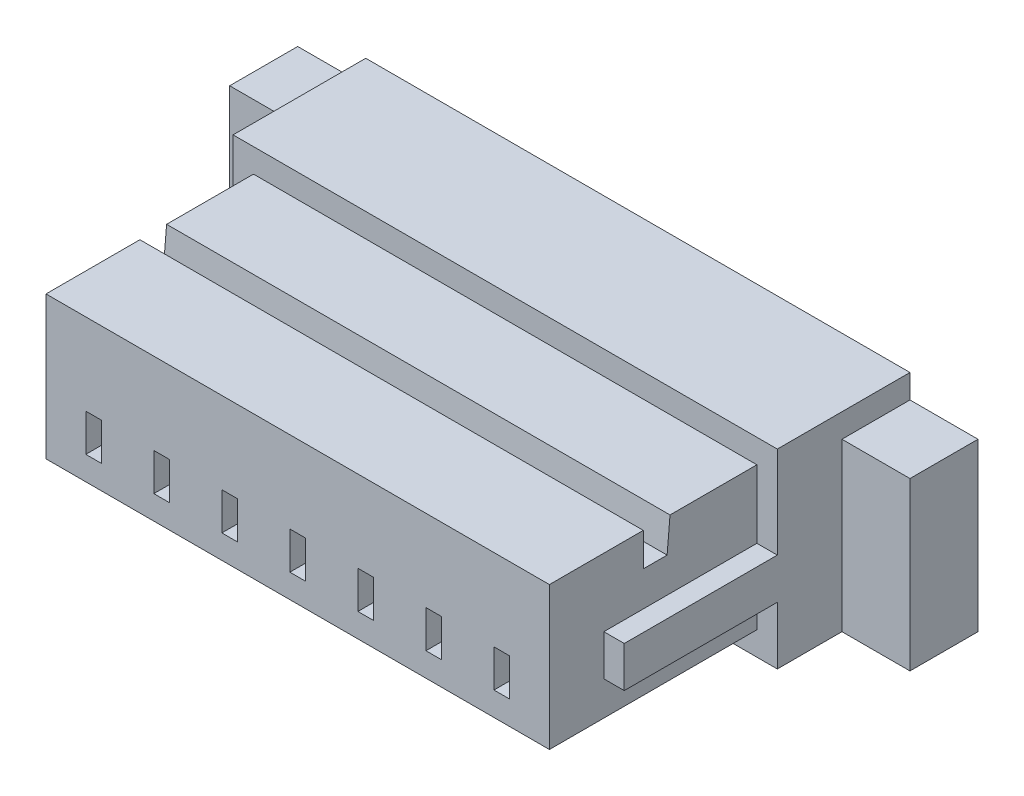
ISO-10303-21;
HEADER;
FILE_DESCRIPTION(('STEP AP214'),'2;1');
FILE_NAME('part.step','',(''),(''),'','','');
FILE_SCHEMA(('AUTOMOTIVE_DESIGN { 1 0 10303 214 1 1 1 1 }'));
ENDSEC;
DATA;
#1=APPLICATION_CONTEXT('core data for automotive mechanical design processes');
#2=APPLICATION_PROTOCOL_DEFINITION('international standard','automotive_design',2000,#1);
#3=PRODUCT_CONTEXT('',#1,'mechanical');
#4=PRODUCT('Part','Part','',(#3));
#5=PRODUCT_RELATED_PRODUCT_CATEGORY('part','',(#4));
#6=PRODUCT_DEFINITION_FORMATION('','',#4);
#7=PRODUCT_DEFINITION_CONTEXT('part definition',#1,'design');
#8=PRODUCT_DEFINITION('design','',#6,#7);
#9=PRODUCT_DEFINITION_SHAPE('','',#8);
#10=(LENGTH_UNIT() NAMED_UNIT(*) SI_UNIT(.MILLI.,.METRE.));
#11=(NAMED_UNIT(*) PLANE_ANGLE_UNIT() SI_UNIT($,.RADIAN.));
#12=(NAMED_UNIT(*) SI_UNIT($,.STERADIAN.) SOLID_ANGLE_UNIT());
#13=UNCERTAINTY_MEASURE_WITH_UNIT(LENGTH_MEASURE(1.E-05),#10,'distance_accuracy_value','');
#14=(GEOMETRIC_REPRESENTATION_CONTEXT(3) GLOBAL_UNCERTAINTY_ASSIGNED_CONTEXT((#13)) GLOBAL_UNIT_ASSIGNED_CONTEXT((#10,
#11,#12)) REPRESENTATION_CONTEXT('',''));
#15=CARTESIAN_POINT('',(0.,0.,0.));
#16=DIRECTION('',(0.,0.,1.));
#17=DIRECTION('',(1.,0.,0.));
#18=AXIS2_PLACEMENT_3D('',#15,#16,#17);
#19=CARTESIAN_POINT('',(-0.885,-3.1999625,3.6000125));
#20=DIRECTION('',(0.,0.,-1.));
#21=DIRECTION('',(0.,-1.,0.));
#22=AXIS2_PLACEMENT_3D('',#19,#20,#21);
#23=PLANE('',#22);
#24=DIRECTION('',(0.,1.,0.));
#25=VECTOR('',#24,1.);
#26=CARTESIAN_POINT('',(-0.885,-2.64996249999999,3.6000125));
#27=LINE('',#26,#25);
#28=CARTESIAN_POINT('',(-0.885,-3.1999625,3.6000125));
#29=VERTEX_POINT('',#28);
#30=CARTESIAN_POINT('',(-0.885,-2.64996249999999,3.6000125));
#31=VERTEX_POINT('',#30);
#32=EDGE_CURVE('E805',#29,#31,#27,.T.);
#33=ORIENTED_EDGE('',*,*,#32,.T.);
#34=DIRECTION('',(-1.,0.,0.));
#35=VECTOR('',#34,1.);
#36=CARTESIAN_POINT('',(-1.115,-2.64996249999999,3.6000125));
#37=LINE('',#36,#35);
#38=CARTESIAN_POINT('',(-1.115,-2.64996249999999,3.6000125));
#39=VERTEX_POINT('',#38);
#40=EDGE_CURVE('E801',#31,#39,#37,.T.);
#41=ORIENTED_EDGE('',*,*,#40,.T.);
#42=DIRECTION('',(0.,-1.,0.));
#43=VECTOR('',#42,1.);
#44=CARTESIAN_POINT('',(-1.115,-2.64996249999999,3.6000125));
#45=LINE('',#44,#43);
#46=CARTESIAN_POINT('',(-1.115,-3.1999625,3.6000125));
#47=VERTEX_POINT('',#46);
#48=EDGE_CURVE('E1037',#39,#47,#45,.T.);
#49=ORIENTED_EDGE('',*,*,#48,.T.);
#50=DIRECTION('',(1.,0.,0.));
#51=VECTOR('',#50,1.);
#52=CARTESIAN_POINT('',(-0.885,-3.1999625,3.6000125));
#53=LINE('',#52,#51);
#54=EDGE_CURVE('E1231',#47,#29,#53,.T.);
#55=ORIENTED_EDGE('',*,*,#54,.T.);
#56=EDGE_LOOP('',(#33,#41,#49,#55));
#57=FACE_BOUND('',#56,.T.);
#58=ADVANCED_FACE('F15',(#57),#23,.F.);
#59=CARTESIAN_POINT('',(2.115,-3.1999625,3.6000125));
#60=DIRECTION('',(0.,0.,-1.));
#61=DIRECTION('',(0.,-1.,0.));
#62=AXIS2_PLACEMENT_3D('',#59,#60,#61);
#63=PLANE('',#62);
#64=DIRECTION('',(0.,1.,0.));
#65=VECTOR('',#64,1.);
#66=CARTESIAN_POINT('',(2.115,-2.64996249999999,3.6000125));
#67=LINE('',#66,#65);
#68=CARTESIAN_POINT('',(2.115,-3.1999625,3.6000125));
#69=VERTEX_POINT('',#68);
#70=CARTESIAN_POINT('',(2.115,-2.64996249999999,3.6000125));
#71=VERTEX_POINT('',#70);
#72=EDGE_CURVE('E850',#69,#71,#67,.T.);
#73=ORIENTED_EDGE('',*,*,#72,.T.);
#74=DIRECTION('',(-1.,0.,0.));
#75=VECTOR('',#74,1.);
#76=CARTESIAN_POINT('',(1.885,-2.64996249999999,3.6000125));
#77=LINE('',#76,#75);
#78=CARTESIAN_POINT('',(1.885,-2.64996249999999,3.6000125));
#79=VERTEX_POINT('',#78);
#80=EDGE_CURVE('E1062',#71,#79,#77,.T.);
#81=ORIENTED_EDGE('',*,*,#80,.T.);
#82=DIRECTION('',(0.,-1.,0.));
#83=VECTOR('',#82,1.);
#84=CARTESIAN_POINT('',(1.885,-2.64996249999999,3.6000125));
#85=LINE('',#84,#83);
#86=CARTESIAN_POINT('',(1.885,-3.1999625,3.6000125));
#87=VERTEX_POINT('',#86);
#88=EDGE_CURVE('E942',#79,#87,#85,.T.);
#89=ORIENTED_EDGE('',*,*,#88,.T.);
#90=DIRECTION('',(1.,0.,0.));
#91=VECTOR('',#90,1.);
#92=CARTESIAN_POINT('',(2.115,-3.1999625,3.6000125));
#93=LINE('',#92,#91);
#94=EDGE_CURVE('E725',#87,#69,#93,.T.);
#95=ORIENTED_EDGE('',*,*,#94,.T.);
#96=EDGE_LOOP('',(#73,#81,#89,#95));
#97=FACE_BOUND('',#96,.T.);
#98=ADVANCED_FACE('F1653',(#97),#63,.F.);
#99=CARTESIAN_POINT('',(-1.885,-3.1999625,3.6000125));
#100=DIRECTION('',(0.,0.,-1.));
#101=DIRECTION('',(0.,-1.,0.));
#102=AXIS2_PLACEMENT_3D('',#99,#100,#101);
#103=PLANE('',#102);
#104=DIRECTION('',(0.,1.,0.));
#105=VECTOR('',#104,1.);
#106=CARTESIAN_POINT('',(-1.885,-2.64996249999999,3.6000125));
#107=LINE('',#106,#105);
#108=CARTESIAN_POINT('',(-1.885,-3.1999625,3.6000125));
#109=VERTEX_POINT('',#108);
#110=CARTESIAN_POINT('',(-1.885,-2.64996249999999,3.6000125));
#111=VERTEX_POINT('',#110);
#112=EDGE_CURVE('E1032',#109,#111,#107,.T.);
#113=ORIENTED_EDGE('',*,*,#112,.T.);
#114=DIRECTION('',(-1.,0.,0.));
#115=VECTOR('',#114,1.);
#116=CARTESIAN_POINT('',(-2.115,-2.64996249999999,3.6000125));
#117=LINE('',#116,#115);
#118=CARTESIAN_POINT('',(-2.115,-2.64996249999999,3.6000125));
#119=VERTEX_POINT('',#118);
#120=EDGE_CURVE('E41',#111,#119,#117,.T.);
#121=ORIENTED_EDGE('',*,*,#120,.T.);
#122=DIRECTION('',(0.,-1.,0.));
#123=VECTOR('',#122,1.);
#124=CARTESIAN_POINT('',(-2.115,-2.64996249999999,3.6000125));
#125=LINE('',#124,#123);
#126=CARTESIAN_POINT('',(-2.115,-3.1999625,3.6000125));
#127=VERTEX_POINT('',#126);
#128=EDGE_CURVE('E695',#119,#127,#125,.T.);
#129=ORIENTED_EDGE('',*,*,#128,.T.);
#130=DIRECTION('',(1.,0.,0.));
#131=VECTOR('',#130,1.);
#132=CARTESIAN_POINT('',(-1.885,-3.1999625,3.6000125));
#133=LINE('',#132,#131);
#134=EDGE_CURVE('E851',#127,#109,#133,.T.);
#135=ORIENTED_EDGE('',*,*,#134,.T.);
#136=EDGE_LOOP('',(#113,#121,#129,#135));
#137=FACE_BOUND('',#136,.T.);
#138=ADVANCED_FACE('F1659',(#137),#103,.F.);
#139=CARTESIAN_POINT('',(3.115,-3.1999625,3.6000125));
#140=DIRECTION('',(0.,0.,-1.));
#141=DIRECTION('',(0.,-1.,0.));
#142=AXIS2_PLACEMENT_3D('',#139,#140,#141);
#143=PLANE('',#142);
#144=DIRECTION('',(0.,1.,0.));
#145=VECTOR('',#144,1.);
#146=CARTESIAN_POINT('',(3.115,-2.64996249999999,3.6000125));
#147=LINE('',#146,#145);
#148=CARTESIAN_POINT('',(3.115,-3.1999625,3.6000125));
#149=VERTEX_POINT('',#148);
#150=CARTESIAN_POINT('',(3.115,-2.64996249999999,3.6000125));
#151=VERTEX_POINT('',#150);
#152=EDGE_CURVE('E750',#149,#151,#147,.T.);
#153=ORIENTED_EDGE('',*,*,#152,.T.);
#154=DIRECTION('',(-1.,0.,0.));
#155=VECTOR('',#154,1.);
#156=CARTESIAN_POINT('',(2.885,-2.64996249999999,3.6000125));
#157=LINE('',#156,#155);
#158=CARTESIAN_POINT('',(2.885,-2.64996249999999,3.6000125));
#159=VERTEX_POINT('',#158);
#160=EDGE_CURVE('E9',#151,#159,#157,.T.);
#161=ORIENTED_EDGE('',*,*,#160,.T.);
#162=DIRECTION('',(0.,-1.,0.));
#163=VECTOR('',#162,1.);
#164=CARTESIAN_POINT('',(2.885,-2.64996249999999,3.6000125));
#165=LINE('',#164,#163);
#166=CARTESIAN_POINT('',(2.885,-3.1999625,3.6000125));
#167=VERTEX_POINT('',#166);
#168=EDGE_CURVE('E804',#159,#167,#165,.T.);
#169=ORIENTED_EDGE('',*,*,#168,.T.);
#170=DIRECTION('',(1.,0.,0.));
#171=VECTOR('',#170,1.);
#172=CARTESIAN_POINT('',(3.115,-3.1999625,3.6000125));
#173=LINE('',#172,#171);
#174=EDGE_CURVE('E1197',#167,#149,#173,.T.);
#175=ORIENTED_EDGE('',*,*,#174,.T.);
#176=EDGE_LOOP('',(#153,#161,#169,#175));
#177=FACE_BOUND('',#176,.T.);
#178=ADVANCED_FACE('F1825',(#177),#143,.F.);
#179=CARTESIAN_POINT('',(0.115,-3.1999625,3.6000125));
#180=DIRECTION('',(0.,0.,-1.));
#181=DIRECTION('',(0.,-1.,0.));
#182=AXIS2_PLACEMENT_3D('',#179,#180,#181);
#183=PLANE('',#182);
#184=DIRECTION('',(0.,1.,0.));
#185=VECTOR('',#184,1.);
#186=CARTESIAN_POINT('',(0.115,-2.64996249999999,3.6000125));
#187=LINE('',#186,#185);
#188=CARTESIAN_POINT('',(0.115,-3.1999625,3.6000125));
#189=VERTEX_POINT('',#188);
#190=CARTESIAN_POINT('',(0.115,-2.64996249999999,3.6000125));
#191=VERTEX_POINT('',#190);
#192=EDGE_CURVE('E795',#189,#191,#187,.T.);
#193=ORIENTED_EDGE('',*,*,#192,.T.);
#194=DIRECTION('',(-1.,0.,0.));
#195=VECTOR('',#194,1.);
#196=CARTESIAN_POINT('',(-0.115,-2.64996249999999,3.6000125));
#197=LINE('',#196,#195);
#198=CARTESIAN_POINT('',(-0.115,-2.64996249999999,3.6000125));
#199=VERTEX_POINT('',#198);
#200=EDGE_CURVE('E891',#191,#199,#197,.T.);
#201=ORIENTED_EDGE('',*,*,#200,.T.);
#202=DIRECTION('',(0.,-1.,0.));
#203=VECTOR('',#202,1.);
#204=CARTESIAN_POINT('',(-0.115,-2.64996249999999,3.6000125));
#205=LINE('',#204,#203);
#206=CARTESIAN_POINT('',(-0.115,-3.1999625,3.6000125));
#207=VERTEX_POINT('',#206);
#208=EDGE_CURVE('E26',#199,#207,#205,.T.);
#209=ORIENTED_EDGE('',*,*,#208,.T.);
#210=DIRECTION('',(1.,0.,0.));
#211=VECTOR('',#210,1.);
#212=CARTESIAN_POINT('',(0.115,-3.1999625,3.6000125));
#213=LINE('',#212,#211);
#214=EDGE_CURVE('E1235',#207,#189,#213,.T.);
#215=ORIENTED_EDGE('',*,*,#214,.T.);
#216=EDGE_LOOP('',(#193,#201,#209,#215));
#217=FACE_BOUND('',#216,.T.);
#218=ADVANCED_FACE('F1713',(#217),#183,.F.);
#219=CARTESIAN_POINT('',(-2.885,-3.1999625,3.6000125));
#220=DIRECTION('',(0.,0.,-1.));
#221=DIRECTION('',(0.,-1.,0.));
#222=AXIS2_PLACEMENT_3D('',#219,#220,#221);
#223=PLANE('',#222);
#224=DIRECTION('',(0.,1.,0.));
#225=VECTOR('',#224,1.);
#226=CARTESIAN_POINT('',(-2.885,-2.64996249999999,3.6000125));
#227=LINE('',#226,#225);
#228=CARTESIAN_POINT('',(-2.885,-3.1999625,3.6000125));
#229=VERTEX_POINT('',#228);
#230=CARTESIAN_POINT('',(-2.885,-2.64996249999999,3.6000125));
#231=VERTEX_POINT('',#230);
#232=EDGE_CURVE('E694',#229,#231,#227,.T.);
#233=ORIENTED_EDGE('',*,*,#232,.T.);
#234=DIRECTION('',(-1.,0.,0.));
#235=VECTOR('',#234,1.);
#236=CARTESIAN_POINT('',(-3.115,-2.64996249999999,3.6000125));
#237=LINE('',#236,#235);
#238=CARTESIAN_POINT('',(-3.115,-2.64996249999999,3.6000125));
#239=VERTEX_POINT('',#238);
#240=EDGE_CURVE('E729',#231,#239,#237,.T.);
#241=ORIENTED_EDGE('',*,*,#240,.T.);
#242=DIRECTION('',(0.,-1.,0.));
#243=VECTOR('',#242,1.);
#244=CARTESIAN_POINT('',(-3.115,-2.64996249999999,3.6000125));
#245=LINE('',#244,#243);
#246=CARTESIAN_POINT('',(-3.115,-3.1999625,3.6000125));
#247=VERTEX_POINT('',#246);
#248=EDGE_CURVE('E910',#239,#247,#245,.T.);
#249=ORIENTED_EDGE('',*,*,#248,.T.);
#250=DIRECTION('',(1.,0.,0.));
#251=VECTOR('',#250,1.);
#252=CARTESIAN_POINT('',(-2.885,-3.1999625,3.6000125));
#253=LINE('',#252,#251);
#254=EDGE_CURVE('E1076',#247,#229,#253,.T.);
#255=ORIENTED_EDGE('',*,*,#254,.T.);
#256=EDGE_LOOP('',(#233,#241,#249,#255));
#257=FACE_BOUND('',#256,.T.);
#258=ADVANCED_FACE('F1710',(#257),#223,.F.);
#259=CARTESIAN_POINT('',(1.115,-3.1999625,3.6000125));
#260=DIRECTION('',(0.,0.,-1.));
#261=DIRECTION('',(0.,-1.,0.));
#262=AXIS2_PLACEMENT_3D('',#259,#260,#261);
#263=PLANE('',#262);
#264=DIRECTION('',(0.,1.,0.));
#265=VECTOR('',#264,1.);
#266=CARTESIAN_POINT('',(1.115,-2.64996249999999,3.6000125));
#267=LINE('',#266,#265);
#268=CARTESIAN_POINT('',(1.115,-3.1999625,3.6000125));
#269=VERTEX_POINT('',#268);
#270=CARTESIAN_POINT('',(1.115,-2.64996249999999,3.6000125));
#271=VERTEX_POINT('',#270);
#272=EDGE_CURVE('E1045',#269,#271,#267,.T.);
#273=ORIENTED_EDGE('',*,*,#272,.T.);
#274=DIRECTION('',(-1.,0.,0.));
#275=VECTOR('',#274,1.);
#276=CARTESIAN_POINT('',(0.885,-2.64996249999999,3.6000125));
#277=LINE('',#276,#275);
#278=CARTESIAN_POINT('',(0.885,-2.64996249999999,3.6000125));
#279=VERTEX_POINT('',#278);
#280=EDGE_CURVE('E1058',#271,#279,#277,.T.);
#281=ORIENTED_EDGE('',*,*,#280,.T.);
#282=DIRECTION('',(0.,-1.,0.));
#283=VECTOR('',#282,1.);
#284=CARTESIAN_POINT('',(0.885,-2.64996249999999,3.6000125));
#285=LINE('',#284,#283);
#286=CARTESIAN_POINT('',(0.885,-3.1999625,3.6000125));
#287=VERTEX_POINT('',#286);
#288=EDGE_CURVE('E855',#279,#287,#285,.T.);
#289=ORIENTED_EDGE('',*,*,#288,.T.);
#290=DIRECTION('',(1.,0.,0.));
#291=VECTOR('',#290,1.);
#292=CARTESIAN_POINT('',(1.115,-3.1999625,3.6000125));
#293=LINE('',#292,#291);
#294=EDGE_CURVE('E1001',#287,#269,#293,.T.);
#295=ORIENTED_EDGE('',*,*,#294,.T.);
#296=EDGE_LOOP('',(#273,#281,#289,#295));
#297=FACE_BOUND('',#296,.T.);
#298=ADVANCED_FACE('F1533',(#297),#263,.F.);
#299=CARTESIAN_POINT('',(2.885,-2.64996249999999,3.6000125));
#300=DIRECTION('',(0.,1.,0.));
#301=DIRECTION('',(0.,0.,-1.));
#302=AXIS2_PLACEMENT_3D('',#299,#300,#301);
#303=PLANE('',#302);
#304=DIRECTION('',(-1.,0.,0.));
#305=VECTOR('',#304,1.);
#306=CARTESIAN_POINT('',(2.885,-2.64996249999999,3.9000125));
#307=LINE('',#306,#305);
#308=CARTESIAN_POINT('',(3.115,-2.64996249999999,3.9000125));
#309=VERTEX_POINT('',#308);
#310=CARTESIAN_POINT('',(2.885,-2.64996249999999,3.9000125));
#311=VERTEX_POINT('',#310);
#312=EDGE_CURVE('E1133',#309,#311,#307,.T.);
#313=ORIENTED_EDGE('',*,*,#312,.T.);
#314=DIRECTION('',(0.,0.,1.));
#315=VECTOR('',#314,1.);
#316=CARTESIAN_POINT('',(2.885,-2.64996249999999,3.6000125));
#317=LINE('',#316,#315);
#318=EDGE_CURVE('E690',#159,#311,#317,.T.);
#319=ORIENTED_EDGE('',*,*,#318,.F.);
#320=ORIENTED_EDGE('',*,*,#160,.F.);
#321=DIRECTION('',(0.,0.,1.));
#322=VECTOR('',#321,1.);
#323=CARTESIAN_POINT('',(3.115,-2.64996249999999,3.6000125));
#324=LINE('',#323,#322);
#325=EDGE_CURVE('E755',#151,#309,#324,.T.);
#326=ORIENTED_EDGE('',*,*,#325,.T.);
#327=EDGE_LOOP('',(#313,#319,#320,#326));
#328=FACE_BOUND('',#327,.T.);
#329=ADVANCED_FACE('F1782',(#328),#303,.F.);
#330=CARTESIAN_POINT('',(-0.115,-2.64996249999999,3.6000125));
#331=DIRECTION('',(-1.,0.,0.));
#332=DIRECTION('',(0.,0.,1.));
#333=AXIS2_PLACEMENT_3D('',#330,#331,#332);
#334=PLANE('',#333);
#335=DIRECTION('',(0.,-1.,0.));
#336=VECTOR('',#335,1.);
#337=CARTESIAN_POINT('',(-0.115,-2.64996249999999,3.9000125));
#338=LINE('',#337,#336);
#339=CARTESIAN_POINT('',(-0.115,-2.64996249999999,3.9000125));
#340=VERTEX_POINT('',#339);
#341=CARTESIAN_POINT('',(-0.115,-3.19996249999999,3.9000125));
#342=VERTEX_POINT('',#341);
#343=EDGE_CURVE('E1028',#340,#342,#338,.T.);
#344=ORIENTED_EDGE('',*,*,#343,.T.);
#345=DIRECTION('',(0.,0.,1.));
#346=VECTOR('',#345,1.);
#347=CARTESIAN_POINT('',(-0.115,-3.1999625,3.6000125));
#348=LINE('',#347,#346);
#349=EDGE_CURVE('E1267',#207,#342,#348,.T.);
#350=ORIENTED_EDGE('',*,*,#349,.F.);
#351=ORIENTED_EDGE('',*,*,#208,.F.);
#352=DIRECTION('',(0.,0.,1.));
#353=VECTOR('',#352,1.);
#354=CARTESIAN_POINT('',(-0.115,-2.64996249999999,3.6000125));
#355=LINE('',#354,#353);
#356=EDGE_CURVE('E887',#199,#340,#355,.T.);
#357=ORIENTED_EDGE('',*,*,#356,.T.);
#358=EDGE_LOOP('',(#344,#350,#351,#357));
#359=FACE_BOUND('',#358,.T.);
#360=ADVANCED_FACE('F1778',(#359),#334,.F.);
#361=CARTESIAN_POINT('',(-2.115,-2.64996249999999,3.6000125));
#362=DIRECTION('',(0.,1.,0.));
#363=DIRECTION('',(0.,0.,-1.));
#364=AXIS2_PLACEMENT_3D('',#361,#362,#363);
#365=PLANE('',#364);
#366=DIRECTION('',(-1.,0.,0.));
#367=VECTOR('',#366,1.);
#368=CARTESIAN_POINT('',(-2.115,-2.64996249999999,3.9000125));
#369=LINE('',#368,#367);
#370=CARTESIAN_POINT('',(-1.885,-2.64996249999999,3.9000125));
#371=VERTEX_POINT('',#370);
#372=CARTESIAN_POINT('',(-2.115,-2.64996249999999,3.9000125));
#373=VERTEX_POINT('',#372);
#374=EDGE_CURVE('E962',#371,#373,#369,.T.);
#375=ORIENTED_EDGE('',*,*,#374,.T.);
#376=DIRECTION('',(0.,0.,1.));
#377=VECTOR('',#376,1.);
#378=CARTESIAN_POINT('',(-2.115,-2.64996249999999,3.6000125));
#379=LINE('',#378,#377);
#380=EDGE_CURVE('E692',#119,#373,#379,.T.);
#381=ORIENTED_EDGE('',*,*,#380,.F.);
#382=ORIENTED_EDGE('',*,*,#120,.F.);
#383=DIRECTION('',(0.,0.,1.));
#384=VECTOR('',#383,1.);
#385=CARTESIAN_POINT('',(-1.885,-2.64996249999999,3.6000125));
#386=LINE('',#385,#384);
#387=EDGE_CURVE('E1029',#111,#371,#386,.T.);
#388=ORIENTED_EDGE('',*,*,#387,.T.);
#389=EDGE_LOOP('',(#375,#381,#382,#388));
#390=FACE_BOUND('',#389,.T.);
#391=ADVANCED_FACE('F1781',(#390),#365,.F.);
#392=CARTESIAN_POINT('',(-2.885,-2.64996249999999,3.6000125));
#393=DIRECTION('',(1.,0.,0.));
#394=DIRECTION('',(0.,1.,0.));
#395=AXIS2_PLACEMENT_3D('',#392,#393,#394);
#396=PLANE('',#395);
#397=DIRECTION('',(0.,1.,0.));
#398=VECTOR('',#397,1.);
#399=CARTESIAN_POINT('',(-2.885,-2.64996249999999,3.9000125));
#400=LINE('',#399,#398);
#401=CARTESIAN_POINT('',(-2.885,-3.19996249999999,3.9000125));
#402=VERTEX_POINT('',#401);
#403=CARTESIAN_POINT('',(-2.885,-2.64996249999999,3.9000125));
#404=VERTEX_POINT('',#403);
#405=EDGE_CURVE('E881',#402,#404,#400,.T.);
#406=ORIENTED_EDGE('',*,*,#405,.T.);
#407=DIRECTION('',(0.,0.,1.));
#408=VECTOR('',#407,1.);
#409=CARTESIAN_POINT('',(-2.885,-2.64996249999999,3.6000125));
#410=LINE('',#409,#408);
#411=EDGE_CURVE('E1246',#231,#404,#410,.T.);
#412=ORIENTED_EDGE('',*,*,#411,.F.);
#413=ORIENTED_EDGE('',*,*,#232,.F.);
#414=DIRECTION('',(0.,0.,1.));
#415=VECTOR('',#414,1.);
#416=CARTESIAN_POINT('',(-2.885,-3.1999625,3.6000125));
#417=LINE('',#416,#415);
#418=EDGE_CURVE('E1044',#229,#402,#417,.T.);
#419=ORIENTED_EDGE('',*,*,#418,.T.);
#420=EDGE_LOOP('',(#406,#412,#413,#419));
#421=FACE_BOUND('',#420,.T.);
#422=ADVANCED_FACE('F1920',(#421),#396,.F.);
#423=CARTESIAN_POINT('',(-2.115,-2.64996249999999,3.6000125));
#424=DIRECTION('',(-1.,0.,0.));
#425=DIRECTION('',(0.,0.,1.));
#426=AXIS2_PLACEMENT_3D('',#423,#424,#425);
#427=PLANE('',#426);
#428=DIRECTION('',(0.,-1.,0.));
#429=VECTOR('',#428,1.);
#430=CARTESIAN_POINT('',(-2.115,-2.64996249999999,3.9000125));
#431=LINE('',#430,#429);
#432=CARTESIAN_POINT('',(-2.115,-3.19996249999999,3.9000125));
#433=VERTEX_POINT('',#432);
#434=EDGE_CURVE('E1266',#373,#433,#431,.T.);
#435=ORIENTED_EDGE('',*,*,#434,.T.);
#436=DIRECTION('',(0.,0.,1.));
#437=VECTOR('',#436,1.);
#438=CARTESIAN_POINT('',(-2.115,-3.1999625,3.6000125));
#439=LINE('',#438,#437);
#440=EDGE_CURVE('E854',#127,#433,#439,.T.);
#441=ORIENTED_EDGE('',*,*,#440,.F.);
#442=ORIENTED_EDGE('',*,*,#128,.F.);
#443=ORIENTED_EDGE('',*,*,#380,.T.);
#444=EDGE_LOOP('',(#435,#441,#442,#443));
#445=FACE_BOUND('',#444,.T.);
#446=ADVANCED_FACE('F1840',(#445),#427,.F.);
#447=CARTESIAN_POINT('',(2.885,-2.64996249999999,3.6000125));
#448=DIRECTION('',(-1.,0.,0.));
#449=DIRECTION('',(0.,0.,1.));
#450=AXIS2_PLACEMENT_3D('',#447,#448,#449);
#451=PLANE('',#450);
#452=DIRECTION('',(0.,-1.,0.));
#453=VECTOR('',#452,1.);
#454=CARTESIAN_POINT('',(2.885,-2.64996249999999,3.9000125));
#455=LINE('',#454,#453);
#456=CARTESIAN_POINT('',(2.885,-3.19996249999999,3.9000125));
#457=VERTEX_POINT('',#456);
#458=EDGE_CURVE('E1134',#311,#457,#455,.T.);
#459=ORIENTED_EDGE('',*,*,#458,.T.);
#460=DIRECTION('',(0.,0.,1.));
#461=VECTOR('',#460,1.);
#462=CARTESIAN_POINT('',(2.885,-3.1999625,3.6000125));
#463=LINE('',#462,#461);
#464=EDGE_CURVE('E1194',#167,#457,#463,.T.);
#465=ORIENTED_EDGE('',*,*,#464,.F.);
#466=ORIENTED_EDGE('',*,*,#168,.F.);
#467=ORIENTED_EDGE('',*,*,#318,.T.);
#468=EDGE_LOOP('',(#459,#465,#466,#467));
#469=FACE_BOUND('',#468,.T.);
#470=ADVANCED_FACE('F1837',(#469),#451,.F.);
#471=CARTESIAN_POINT('',(-1.115,-2.64996249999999,3.6000125));
#472=DIRECTION('',(0.,1.,0.));
#473=DIRECTION('',(0.,0.,-1.));
#474=AXIS2_PLACEMENT_3D('',#471,#472,#473);
#475=PLANE('',#474);
#476=DIRECTION('',(-1.,0.,0.));
#477=VECTOR('',#476,1.);
#478=CARTESIAN_POINT('',(-1.115,-2.64996249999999,3.9000125));
#479=LINE('',#478,#477);
#480=CARTESIAN_POINT('',(-0.885,-2.64996249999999,3.9000125));
#481=VERTEX_POINT('',#480);
#482=CARTESIAN_POINT('',(-1.115,-2.64996249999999,3.9000125));
#483=VERTEX_POINT('',#482);
#484=EDGE_CURVE('E1024',#481,#483,#479,.T.);
#485=ORIENTED_EDGE('',*,*,#484,.T.);
#486=DIRECTION('',(0.,0.,1.));
#487=VECTOR('',#486,1.);
#488=CARTESIAN_POINT('',(-1.115,-2.64996249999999,3.6000125));
#489=LINE('',#488,#487);
#490=EDGE_CURVE('E1033',#39,#483,#489,.T.);
#491=ORIENTED_EDGE('',*,*,#490,.F.);
#492=ORIENTED_EDGE('',*,*,#40,.F.);
#493=DIRECTION('',(0.,0.,1.));
#494=VECTOR('',#493,1.);
#495=CARTESIAN_POINT('',(-0.885,-2.64996249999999,3.6000125));
#496=LINE('',#495,#494);
#497=EDGE_CURVE('E880',#31,#481,#496,.T.);
#498=ORIENTED_EDGE('',*,*,#497,.T.);
#499=EDGE_LOOP('',(#485,#491,#492,#498));
#500=FACE_BOUND('',#499,.T.);
#501=ADVANCED_FACE('F1801',(#500),#475,.F.);
#502=CARTESIAN_POINT('',(-0.885,-2.64996249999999,3.6000125));
#503=DIRECTION('',(1.,0.,0.));
#504=DIRECTION('',(0.,1.,0.));
#505=AXIS2_PLACEMENT_3D('',#502,#503,#504);
#506=PLANE('',#505);
#507=DIRECTION('',(0.,1.,0.));
#508=VECTOR('',#507,1.);
#509=CARTESIAN_POINT('',(-0.885,-2.64996249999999,3.9000125));
#510=LINE('',#509,#508);
#511=CARTESIAN_POINT('',(-0.885,-3.19996249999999,3.9000125));
#512=VERTEX_POINT('',#511);
#513=EDGE_CURVE('E1019',#512,#481,#510,.T.);
#514=ORIENTED_EDGE('',*,*,#513,.T.);
#515=ORIENTED_EDGE('',*,*,#497,.F.);
#516=ORIENTED_EDGE('',*,*,#32,.F.);
#517=DIRECTION('',(0.,0.,1.));
#518=VECTOR('',#517,1.);
#519=CARTESIAN_POINT('',(-0.885,-3.1999625,3.6000125));
#520=LINE('',#519,#518);
#521=EDGE_CURVE('E1036',#29,#512,#520,.T.);
#522=ORIENTED_EDGE('',*,*,#521,.T.);
#523=EDGE_LOOP('',(#514,#515,#516,#522));
#524=FACE_BOUND('',#523,.T.);
#525=ADVANCED_FACE('F1797',(#524),#506,.F.);
#526=CARTESIAN_POINT('',(-1.885,-3.1999625,3.6000125));
#527=DIRECTION('',(0.,-1.,0.));
#528=DIRECTION('',(-1.,0.,0.));
#529=AXIS2_PLACEMENT_3D('',#526,#527,#528);
#530=PLANE('',#529);
#531=DIRECTION('',(1.,0.,0.));
#532=VECTOR('',#531,1.);
#533=CARTESIAN_POINT('',(-1.885,-3.19996249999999,3.9000125));
#534=LINE('',#533,#532);
#535=CARTESIAN_POINT('',(-1.885,-3.19996249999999,3.9000125));
#536=VERTEX_POINT('',#535);
#537=EDGE_CURVE('E1072',#433,#536,#534,.T.);
#538=ORIENTED_EDGE('',*,*,#537,.T.);
#539=DIRECTION('',(0.,0.,1.));
#540=VECTOR('',#539,1.);
#541=CARTESIAN_POINT('',(-1.885,-3.1999625,3.6000125));
#542=LINE('',#541,#540);
#543=EDGE_CURVE('E1113',#109,#536,#542,.T.);
#544=ORIENTED_EDGE('',*,*,#543,.F.);
#545=ORIENTED_EDGE('',*,*,#134,.F.);
#546=ORIENTED_EDGE('',*,*,#440,.T.);
#547=EDGE_LOOP('',(#538,#544,#545,#546));
#548=FACE_BOUND('',#547,.T.);
#549=ADVANCED_FACE('F1800',(#548),#530,.F.);
#550=CARTESIAN_POINT('',(0.885,-2.64996249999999,3.6000125));
#551=DIRECTION('',(-1.,0.,0.));
#552=DIRECTION('',(0.,0.,1.));
#553=AXIS2_PLACEMENT_3D('',#550,#551,#552);
#554=PLANE('',#553);
#555=DIRECTION('',(0.,-1.,0.));
#556=VECTOR('',#555,1.);
#557=CARTESIAN_POINT('',(0.885,-2.64996249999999,3.9000125));
#558=LINE('',#557,#556);
#559=CARTESIAN_POINT('',(0.885,-2.64996249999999,3.9000125));
#560=VERTEX_POINT('',#559);
#561=CARTESIAN_POINT('',(0.885,-3.19996249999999,3.9000125));
#562=VERTEX_POINT('',#561);
#563=EDGE_CURVE('E997',#560,#562,#558,.T.);
#564=ORIENTED_EDGE('',*,*,#563,.T.);
#565=DIRECTION('',(0.,0.,1.));
#566=VECTOR('',#565,1.);
#567=CARTESIAN_POINT('',(0.885,-3.1999625,3.6000125));
#568=LINE('',#567,#566);
#569=EDGE_CURVE('E998',#287,#562,#568,.T.);
#570=ORIENTED_EDGE('',*,*,#569,.F.);
#571=ORIENTED_EDGE('',*,*,#288,.F.);
#572=DIRECTION('',(0.,0.,1.));
#573=VECTOR('',#572,1.);
#574=CARTESIAN_POINT('',(0.885,-2.64996249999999,3.6000125));
#575=LINE('',#574,#573);
#576=EDGE_CURVE('E794',#279,#560,#575,.T.);
#577=ORIENTED_EDGE('',*,*,#576,.T.);
#578=EDGE_LOOP('',(#564,#570,#571,#577));
#579=FACE_BOUND('',#578,.T.);
#580=ADVANCED_FACE('F1551',(#579),#554,.F.);
#581=CARTESIAN_POINT('',(0.115,-3.1999625,3.6000125));
#582=DIRECTION('',(0.,-1.,0.));
#583=DIRECTION('',(-1.,0.,0.));
#584=AXIS2_PLACEMENT_3D('',#581,#582,#583);
#585=PLANE('',#584);
#586=DIRECTION('',(1.,0.,0.));
#587=VECTOR('',#586,1.);
#588=CARTESIAN_POINT('',(0.115,-3.19996249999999,3.9000125));
#589=LINE('',#588,#587);
#590=CARTESIAN_POINT('',(0.115,-3.19996249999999,3.9000125));
#591=VERTEX_POINT('',#590);
#592=EDGE_CURVE('E1104',#342,#591,#589,.T.);
#593=ORIENTED_EDGE('',*,*,#592,.T.);
#594=DIRECTION('',(0.,0.,1.));
#595=VECTOR('',#594,1.);
#596=CARTESIAN_POINT('',(0.115,-3.1999625,3.6000125));
#597=LINE('',#596,#595);
#598=EDGE_CURVE('E791',#189,#591,#597,.T.);
#599=ORIENTED_EDGE('',*,*,#598,.F.);
#600=ORIENTED_EDGE('',*,*,#214,.F.);
#601=ORIENTED_EDGE('',*,*,#349,.T.);
#602=EDGE_LOOP('',(#593,#599,#600,#601));
#603=FACE_BOUND('',#602,.T.);
#604=ADVANCED_FACE('F1671',(#603),#585,.F.);
#605=CARTESIAN_POINT('',(-0.885,-3.1999625,3.6000125));
#606=DIRECTION('',(0.,-1.,0.));
#607=DIRECTION('',(-1.,0.,0.));
#608=AXIS2_PLACEMENT_3D('',#605,#606,#607);
#609=PLANE('',#608);
#610=DIRECTION('',(1.,0.,0.));
#611=VECTOR('',#610,1.);
#612=CARTESIAN_POINT('',(-0.885,-3.19996249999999,3.9000125));
#613=LINE('',#612,#611);
#614=CARTESIAN_POINT('',(-1.115,-3.19996249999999,3.9000125));
#615=VERTEX_POINT('',#614);
#616=EDGE_CURVE('E1023',#615,#512,#613,.T.);
#617=ORIENTED_EDGE('',*,*,#616,.T.);
#618=ORIENTED_EDGE('',*,*,#521,.F.);
#619=ORIENTED_EDGE('',*,*,#54,.F.);
#620=DIRECTION('',(0.,0.,1.));
#621=VECTOR('',#620,1.);
#622=CARTESIAN_POINT('',(-1.115,-3.1999625,3.6000125));
#623=LINE('',#622,#621);
#624=EDGE_CURVE('E1149',#47,#615,#623,.T.);
#625=ORIENTED_EDGE('',*,*,#624,.T.);
#626=EDGE_LOOP('',(#617,#618,#619,#625));
#627=FACE_BOUND('',#626,.T.);
#628=ADVANCED_FACE('F1674',(#627),#609,.F.);
#629=CARTESIAN_POINT('',(-1.115,-2.64996249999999,3.6000125));
#630=DIRECTION('',(-1.,0.,0.));
#631=DIRECTION('',(0.,0.,1.));
#632=AXIS2_PLACEMENT_3D('',#629,#630,#631);
#633=PLANE('',#632);
#634=DIRECTION('',(0.,-1.,0.));
#635=VECTOR('',#634,1.);
#636=CARTESIAN_POINT('',(-1.115,-2.64996249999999,3.9000125));
#637=LINE('',#636,#635);
#638=EDGE_CURVE('E967',#483,#615,#637,.T.);
#639=ORIENTED_EDGE('',*,*,#638,.T.);
#640=ORIENTED_EDGE('',*,*,#624,.F.);
#641=ORIENTED_EDGE('',*,*,#48,.F.);
#642=ORIENTED_EDGE('',*,*,#490,.T.);
#643=EDGE_LOOP('',(#639,#640,#641,#642));
#644=FACE_BOUND('',#643,.T.);
#645=ADVANCED_FACE('F2261',(#644),#633,.F.);
#646=CARTESIAN_POINT('',(1.885,-2.64996249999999,3.6000125));
#647=DIRECTION('',(0.,1.,0.));
#648=DIRECTION('',(0.,0.,-1.));
#649=AXIS2_PLACEMENT_3D('',#646,#647,#648);
#650=PLANE('',#649);
#651=DIRECTION('',(-1.,0.,0.));
#652=VECTOR('',#651,1.);
#653=CARTESIAN_POINT('',(1.885,-2.64996249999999,3.9000125));
#654=LINE('',#653,#652);
#655=CARTESIAN_POINT('',(2.115,-2.64996249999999,3.9000125));
#656=VERTEX_POINT('',#655);
#657=CARTESIAN_POINT('',(1.885,-2.64996249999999,3.9000125));
#658=VERTEX_POINT('',#657);
#659=EDGE_CURVE('E1138',#656,#658,#654,.T.);
#660=ORIENTED_EDGE('',*,*,#659,.T.);
#661=DIRECTION('',(0.,0.,1.));
#662=VECTOR('',#661,1.);
#663=CARTESIAN_POINT('',(1.885,-2.64996249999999,3.6000125));
#664=LINE('',#663,#662);
#665=EDGE_CURVE('E946',#79,#658,#664,.T.);
#666=ORIENTED_EDGE('',*,*,#665,.F.);
#667=ORIENTED_EDGE('',*,*,#80,.F.);
#668=DIRECTION('',(0.,0.,1.));
#669=VECTOR('',#668,1.);
#670=CARTESIAN_POINT('',(2.115,-2.64996249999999,3.6000125));
#671=LINE('',#670,#669);
#672=EDGE_CURVE('E1242',#71,#656,#671,.T.);
#673=ORIENTED_EDGE('',*,*,#672,.T.);
#674=EDGE_LOOP('',(#660,#666,#667,#673));
#675=FACE_BOUND('',#674,.T.);
#676=ADVANCED_FACE('F1811',(#675),#650,.F.);
#677=CARTESIAN_POINT('',(0.885,-2.64996249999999,3.6000125));
#678=DIRECTION('',(0.,1.,0.));
#679=DIRECTION('',(0.,0.,-1.));
#680=AXIS2_PLACEMENT_3D('',#677,#678,#679);
#681=PLANE('',#680);
#682=DIRECTION('',(-1.,0.,0.));
#683=VECTOR('',#682,1.);
#684=CARTESIAN_POINT('',(0.885,-2.64996249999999,3.9000125));
#685=LINE('',#684,#683);
#686=CARTESIAN_POINT('',(1.115,-2.64996249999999,3.9000125));
#687=VERTEX_POINT('',#686);
#688=EDGE_CURVE('E828',#687,#560,#685,.T.);
#689=ORIENTED_EDGE('',*,*,#688,.T.);
#690=ORIENTED_EDGE('',*,*,#576,.F.);
#691=ORIENTED_EDGE('',*,*,#280,.F.);
#692=DIRECTION('',(0.,0.,1.));
#693=VECTOR('',#692,1.);
#694=CARTESIAN_POINT('',(1.115,-2.64996249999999,3.6000125));
#695=LINE('',#694,#693);
#696=EDGE_CURVE('E955',#271,#687,#695,.T.);
#697=ORIENTED_EDGE('',*,*,#696,.T.);
#698=EDGE_LOOP('',(#689,#690,#691,#697));
#699=FACE_BOUND('',#698,.T.);
#700=ADVANCED_FACE('F1547',(#699),#681,.F.);
#701=CARTESIAN_POINT('',(0.115,-2.64996249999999,3.6000125));
#702=DIRECTION('',(1.,0.,0.));
#703=DIRECTION('',(0.,1.,0.));
#704=AXIS2_PLACEMENT_3D('',#701,#702,#703);
#705=PLANE('',#704);
#706=DIRECTION('',(0.,1.,0.));
#707=VECTOR('',#706,1.);
#708=CARTESIAN_POINT('',(0.115,-2.64996249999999,3.9000125));
#709=LINE('',#708,#707);
#710=CARTESIAN_POINT('',(0.115,-2.64996249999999,3.9000125));
#711=VERTEX_POINT('',#710);
#712=EDGE_CURVE('E996',#591,#711,#709,.T.);
#713=ORIENTED_EDGE('',*,*,#712,.T.);
#714=DIRECTION('',(0.,0.,1.));
#715=VECTOR('',#714,1.);
#716=CARTESIAN_POINT('',(0.115,-2.64996249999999,3.6000125));
#717=LINE('',#716,#715);
#718=EDGE_CURVE('E914',#191,#711,#717,.T.);
#719=ORIENTED_EDGE('',*,*,#718,.F.);
#720=ORIENTED_EDGE('',*,*,#192,.F.);
#721=ORIENTED_EDGE('',*,*,#598,.T.);
#722=EDGE_LOOP('',(#713,#719,#720,#721));
#723=FACE_BOUND('',#722,.T.);
#724=ADVANCED_FACE('F1810',(#723),#705,.F.);
#725=CARTESIAN_POINT('',(2.115,-2.64996249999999,3.6000125));
#726=DIRECTION('',(1.,0.,0.));
#727=DIRECTION('',(0.,1.,0.));
#728=AXIS2_PLACEMENT_3D('',#725,#726,#727);
#729=PLANE('',#728);
#730=DIRECTION('',(0.,1.,0.));
#731=VECTOR('',#730,1.);
#732=CARTESIAN_POINT('',(2.115,-2.64996249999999,3.9000125));
#733=LINE('',#732,#731);
#734=CARTESIAN_POINT('',(2.115,-3.19996249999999,3.9000125));
#735=VERTEX_POINT('',#734);
#736=EDGE_CURVE('E1092',#735,#656,#733,.T.);
#737=ORIENTED_EDGE('',*,*,#736,.T.);
#738=ORIENTED_EDGE('',*,*,#672,.F.);
#739=ORIENTED_EDGE('',*,*,#72,.F.);
#740=DIRECTION('',(0.,0.,1.));
#741=VECTOR('',#740,1.);
#742=CARTESIAN_POINT('',(2.115,-3.1999625,3.6000125));
#743=LINE('',#742,#741);
#744=EDGE_CURVE('E730',#69,#735,#743,.T.);
#745=ORIENTED_EDGE('',*,*,#744,.T.);
#746=EDGE_LOOP('',(#737,#738,#739,#745));
#747=FACE_BOUND('',#746,.T.);
#748=ADVANCED_FACE('F1670',(#747),#729,.F.);
#749=CARTESIAN_POINT('',(-3.115,-2.64996249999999,3.6000125));
#750=DIRECTION('',(0.,1.,0.));
#751=DIRECTION('',(0.,0.,-1.));
#752=AXIS2_PLACEMENT_3D('',#749,#750,#751);
#753=PLANE('',#752);
#754=DIRECTION('',(-1.,0.,0.));
#755=VECTOR('',#754,1.);
#756=CARTESIAN_POINT('',(-3.115,-2.64996249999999,3.9000125));
#757=LINE('',#756,#755);
#758=CARTESIAN_POINT('',(-3.115,-2.64996249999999,3.9000125));
#759=VERTEX_POINT('',#758);
#760=EDGE_CURVE('E886',#404,#759,#757,.T.);
#761=ORIENTED_EDGE('',*,*,#760,.T.);
#762=DIRECTION('',(0.,0.,1.));
#763=VECTOR('',#762,1.);
#764=CARTESIAN_POINT('',(-3.115,-2.64996249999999,3.6000125));
#765=LINE('',#764,#763);
#766=EDGE_CURVE('E913',#239,#759,#765,.T.);
#767=ORIENTED_EDGE('',*,*,#766,.F.);
#768=ORIENTED_EDGE('',*,*,#240,.F.);
#769=ORIENTED_EDGE('',*,*,#411,.T.);
#770=EDGE_LOOP('',(#761,#767,#768,#769));
#771=FACE_BOUND('',#770,.T.);
#772=ADVANCED_FACE('F1666',(#771),#753,.F.);
#773=CARTESIAN_POINT('',(2.115,-3.1999625,3.6000125));
#774=DIRECTION('',(0.,-1.,0.));
#775=DIRECTION('',(-1.,0.,0.));
#776=AXIS2_PLACEMENT_3D('',#773,#774,#775);
#777=PLANE('',#776);
#778=DIRECTION('',(1.,0.,0.));
#779=VECTOR('',#778,1.);
#780=CARTESIAN_POINT('',(2.115,-3.19996249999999,3.9000125));
#781=LINE('',#780,#779);
#782=CARTESIAN_POINT('',(1.885,-3.19996249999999,3.9000125));
#783=VERTEX_POINT('',#782);
#784=EDGE_CURVE('E842',#783,#735,#781,.T.);
#785=ORIENTED_EDGE('',*,*,#784,.T.);
#786=ORIENTED_EDGE('',*,*,#744,.F.);
#787=ORIENTED_EDGE('',*,*,#94,.F.);
#788=DIRECTION('',(0.,0.,1.));
#789=VECTOR('',#788,1.);
#790=CARTESIAN_POINT('',(1.885,-3.1999625,3.6000125));
#791=LINE('',#790,#789);
#792=EDGE_CURVE('E947',#87,#783,#791,.T.);
#793=ORIENTED_EDGE('',*,*,#792,.T.);
#794=EDGE_LOOP('',(#785,#786,#787,#793));
#795=FACE_BOUND('',#794,.T.);
#796=ADVANCED_FACE('F1669',(#795),#777,.F.);
#797=CARTESIAN_POINT('',(1.885,-2.64996249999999,3.6000125));
#798=DIRECTION('',(-1.,0.,0.));
#799=DIRECTION('',(0.,0.,1.));
#800=AXIS2_PLACEMENT_3D('',#797,#798,#799);
#801=PLANE('',#800);
#802=DIRECTION('',(0.,-1.,0.));
#803=VECTOR('',#802,1.);
#804=CARTESIAN_POINT('',(1.885,-2.64996249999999,3.9000125));
#805=LINE('',#804,#803);
#806=EDGE_CURVE('E838',#658,#783,#805,.T.);
#807=ORIENTED_EDGE('',*,*,#806,.T.);
#808=ORIENTED_EDGE('',*,*,#792,.F.);
#809=ORIENTED_EDGE('',*,*,#88,.F.);
#810=ORIENTED_EDGE('',*,*,#665,.T.);
#811=EDGE_LOOP('',(#807,#808,#809,#810));
#812=FACE_BOUND('',#811,.T.);
#813=ADVANCED_FACE('F1694',(#812),#801,.F.);
#814=CARTESIAN_POINT('',(3.115,-3.1999625,3.6000125));
#815=DIRECTION('',(0.,-1.,0.));
#816=DIRECTION('',(-1.,0.,0.));
#817=AXIS2_PLACEMENT_3D('',#814,#815,#816);
#818=PLANE('',#817);
#819=DIRECTION('',(1.,0.,0.));
#820=VECTOR('',#819,1.);
#821=CARTESIAN_POINT('',(3.115,-3.19996249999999,3.9000125));
#822=LINE('',#821,#820);
#823=CARTESIAN_POINT('',(3.115,-3.19996249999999,3.9000125));
#824=VERTEX_POINT('',#823);
#825=EDGE_CURVE('E1132',#457,#824,#822,.T.);
#826=ORIENTED_EDGE('',*,*,#825,.T.);
#827=DIRECTION('',(0.,0.,1.));
#828=VECTOR('',#827,1.);
#829=CARTESIAN_POINT('',(3.115,-3.1999625,3.6000125));
#830=LINE('',#829,#828);
#831=EDGE_CURVE('E754',#149,#824,#830,.T.);
#832=ORIENTED_EDGE('',*,*,#831,.F.);
#833=ORIENTED_EDGE('',*,*,#174,.F.);
#834=ORIENTED_EDGE('',*,*,#464,.T.);
#835=EDGE_LOOP('',(#826,#832,#833,#834));
#836=FACE_BOUND('',#835,.T.);
#837=ADVANCED_FACE('F1774',(#836),#818,.F.);
#838=CARTESIAN_POINT('',(-1.885,-2.64996249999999,3.6000125));
#839=DIRECTION('',(1.,0.,0.));
#840=DIRECTION('',(0.,1.,0.));
#841=AXIS2_PLACEMENT_3D('',#838,#839,#840);
#842=PLANE('',#841);
#843=DIRECTION('',(0.,1.,0.));
#844=VECTOR('',#843,1.);
#845=CARTESIAN_POINT('',(-1.885,-2.64996249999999,3.9000125));
#846=LINE('',#845,#844);
#847=EDGE_CURVE('E966',#536,#371,#846,.T.);
#848=ORIENTED_EDGE('',*,*,#847,.T.);
#849=ORIENTED_EDGE('',*,*,#387,.F.);
#850=ORIENTED_EDGE('',*,*,#112,.F.);
#851=ORIENTED_EDGE('',*,*,#543,.T.);
#852=EDGE_LOOP('',(#848,#849,#850,#851));
#853=FACE_BOUND('',#852,.T.);
#854=ADVANCED_FACE('F1765',(#853),#842,.F.);
#855=CARTESIAN_POINT('',(3.115,-2.64996249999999,3.6000125));
#856=DIRECTION('',(1.,0.,0.));
#857=DIRECTION('',(0.,1.,0.));
#858=AXIS2_PLACEMENT_3D('',#855,#856,#857);
#859=PLANE('',#858);
#860=DIRECTION('',(0.,1.,0.));
#861=VECTOR('',#860,1.);
#862=CARTESIAN_POINT('',(3.115,-2.64996249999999,3.9000125));
#863=LINE('',#862,#861);
#864=EDGE_CURVE('E1128',#824,#309,#863,.T.);
#865=ORIENTED_EDGE('',*,*,#864,.T.);
#866=ORIENTED_EDGE('',*,*,#325,.F.);
#867=ORIENTED_EDGE('',*,*,#152,.F.);
#868=ORIENTED_EDGE('',*,*,#831,.T.);
#869=EDGE_LOOP('',(#865,#866,#867,#868));
#870=FACE_BOUND('',#869,.T.);
#871=ADVANCED_FACE('F1762',(#870),#859,.F.);
#872=CARTESIAN_POINT('',(1.115,-3.1999625,3.6000125));
#873=DIRECTION('',(0.,-1.,0.));
#874=DIRECTION('',(-1.,0.,0.));
#875=AXIS2_PLACEMENT_3D('',#872,#873,#874);
#876=PLANE('',#875);
#877=DIRECTION('',(1.,0.,0.));
#878=VECTOR('',#877,1.);
#879=CARTESIAN_POINT('',(1.115,-3.19996249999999,3.9000125));
#880=LINE('',#879,#878);
#881=CARTESIAN_POINT('',(1.115,-3.19996249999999,3.9000125));
#882=VERTEX_POINT('',#881);
#883=EDGE_CURVE('E827',#562,#882,#880,.T.);
#884=ORIENTED_EDGE('',*,*,#883,.T.);
#885=DIRECTION('',(0.,0.,1.));
#886=VECTOR('',#885,1.);
#887=CARTESIAN_POINT('',(1.115,-3.1999625,3.6000125));
#888=LINE('',#887,#886);
#889=EDGE_CURVE('E1041',#269,#882,#888,.T.);
#890=ORIENTED_EDGE('',*,*,#889,.F.);
#891=ORIENTED_EDGE('',*,*,#294,.F.);
#892=ORIENTED_EDGE('',*,*,#569,.T.);
#893=EDGE_LOOP('',(#884,#890,#891,#892));
#894=FACE_BOUND('',#893,.T.);
#895=ADVANCED_FACE('F1540',(#894),#876,.F.);
#896=CARTESIAN_POINT('',(-3.115,-2.64996249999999,3.6000125));
#897=DIRECTION('',(-1.,0.,0.));
#898=DIRECTION('',(0.,0.,1.));
#899=AXIS2_PLACEMENT_3D('',#896,#897,#898);
#900=PLANE('',#899);
#901=DIRECTION('',(0.,-1.,0.));
#902=VECTOR('',#901,1.);
#903=CARTESIAN_POINT('',(-3.115,-2.64996249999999,3.9000125));
#904=LINE('',#903,#902);
#905=CARTESIAN_POINT('',(-3.115,-3.19996249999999,3.9000125));
#906=VERTEX_POINT('',#905);
#907=EDGE_CURVE('E951',#759,#906,#904,.T.);
#908=ORIENTED_EDGE('',*,*,#907,.T.);
#909=DIRECTION('',(0.,0.,1.));
#910=VECTOR('',#909,1.);
#911=CARTESIAN_POINT('',(-3.115,-3.1999625,3.6000125));
#912=LINE('',#911,#910);
#913=EDGE_CURVE('E892',#247,#906,#912,.T.);
#914=ORIENTED_EDGE('',*,*,#913,.F.);
#915=ORIENTED_EDGE('',*,*,#248,.F.);
#916=ORIENTED_EDGE('',*,*,#766,.T.);
#917=EDGE_LOOP('',(#908,#914,#915,#916));
#918=FACE_BOUND('',#917,.T.);
#919=ADVANCED_FACE('F2111',(#918),#900,.F.);
#920=CARTESIAN_POINT('',(-0.115,-2.64996249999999,3.6000125));
#921=DIRECTION('',(0.,1.,0.));
#922=DIRECTION('',(0.,0.,-1.));
#923=AXIS2_PLACEMENT_3D('',#920,#921,#922);
#924=PLANE('',#923);
#925=DIRECTION('',(-1.,0.,0.));
#926=VECTOR('',#925,1.);
#927=CARTESIAN_POINT('',(-0.115,-2.64996249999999,3.9000125));
#928=LINE('',#927,#926);
#929=EDGE_CURVE('E992',#711,#340,#928,.T.);
#930=ORIENTED_EDGE('',*,*,#929,.T.);
#931=ORIENTED_EDGE('',*,*,#356,.F.);
#932=ORIENTED_EDGE('',*,*,#200,.F.);
#933=ORIENTED_EDGE('',*,*,#718,.T.);
#934=EDGE_LOOP('',(#930,#931,#932,#933));
#935=FACE_BOUND('',#934,.T.);
#936=ADVANCED_FACE('F1664',(#935),#924,.F.);
#937=CARTESIAN_POINT('',(-2.885,-3.1999625,3.6000125));
#938=DIRECTION('',(0.,-1.,0.));
#939=DIRECTION('',(-1.,0.,0.));
#940=AXIS2_PLACEMENT_3D('',#937,#938,#939);
#941=PLANE('',#940);
#942=DIRECTION('',(1.,0.,0.));
#943=VECTOR('',#942,1.);
#944=CARTESIAN_POINT('',(-2.885,-3.19996249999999,3.9000125));
#945=LINE('',#944,#943);
#946=EDGE_CURVE('E885',#906,#402,#945,.T.);
#947=ORIENTED_EDGE('',*,*,#946,.T.);
#948=ORIENTED_EDGE('',*,*,#418,.F.);
#949=ORIENTED_EDGE('',*,*,#254,.F.);
#950=ORIENTED_EDGE('',*,*,#913,.T.);
#951=EDGE_LOOP('',(#947,#948,#949,#950));
#952=FACE_BOUND('',#951,.T.);
#953=ADVANCED_FACE('F1819',(#952),#941,.F.);
#954=CARTESIAN_POINT('',(1.115,-2.64996249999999,3.6000125));
#955=DIRECTION('',(1.,0.,0.));
#956=DIRECTION('',(0.,1.,0.));
#957=AXIS2_PLACEMENT_3D('',#954,#955,#956);
#958=PLANE('',#957);
#959=DIRECTION('',(0.,1.,0.));
#960=VECTOR('',#959,1.);
#961=CARTESIAN_POINT('',(1.115,-2.64996249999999,3.9000125));
#962=LINE('',#961,#960);
#963=EDGE_CURVE('E823',#882,#687,#962,.T.);
#964=ORIENTED_EDGE('',*,*,#963,.T.);
#965=ORIENTED_EDGE('',*,*,#696,.F.);
#966=ORIENTED_EDGE('',*,*,#272,.F.);
#967=ORIENTED_EDGE('',*,*,#889,.T.);
#968=EDGE_LOOP('',(#964,#965,#966,#967));
#969=FACE_BOUND('',#968,.T.);
#970=ADVANCED_FACE('F1544',(#969),#958,.F.);
#971=CARTESIAN_POINT('',(4.,-1.93996249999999,2.1700125));
#972=DIRECTION('',(0.,-0.0871557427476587,-0.996194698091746));
#973=DIRECTION('',(0.,-0.996194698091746,0.0871557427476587));
#974=AXIS2_PLACEMENT_3D('',#971,#972,#973);
#975=PLANE('',#974);
#976=DIRECTION('',(-1.,0.,0.));
#977=VECTOR('',#976,1.);
#978=CARTESIAN_POINT('',(4.,-1.4499625,2.12714305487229));
#979=LINE('',#978,#977);
#980=CARTESIAN_POINT('',(3.7,-1.4499625,2.12714305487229));
#981=VERTEX_POINT('',#980);
#982=CARTESIAN_POINT('',(-3.7,-1.4499625,2.12714305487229));
#983=VERTEX_POINT('',#982);
#984=EDGE_CURVE('E760',#981,#983,#979,.T.);
#985=ORIENTED_EDGE('',*,*,#984,.T.);
#986=DIRECTION('',(0.,-0.996194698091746,0.0871557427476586));
#987=VECTOR('',#986,1.);
#988=CARTESIAN_POINT('',(-3.7,-1.4499625,2.12714305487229));
#989=LINE('',#988,#987);
#990=CARTESIAN_POINT('',(-3.7,-1.93996249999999,2.1700125));
#991=VERTEX_POINT('',#990);
#992=EDGE_CURVE('E712',#983,#991,#989,.T.);
#993=ORIENTED_EDGE('',*,*,#992,.T.);
#994=DIRECTION('',(-1.,0.,0.));
#995=VECTOR('',#994,1.);
#996=CARTESIAN_POINT('',(4.,-1.93996249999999,2.1700125));
#997=LINE('',#996,#995);
#998=CARTESIAN_POINT('',(3.7,-1.93996249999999,2.1700125));
#999=VERTEX_POINT('',#998);
#1000=EDGE_CURVE('E1171',#999,#991,#997,.T.);
#1001=ORIENTED_EDGE('',*,*,#1000,.F.);
#1002=DIRECTION('',(0.,-0.996194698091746,0.0871557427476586));
#1003=VECTOR('',#1002,1.);
#1004=CARTESIAN_POINT('',(3.7,-1.4499625,2.12714305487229));
#1005=LINE('',#1004,#1003);
#1006=EDGE_CURVE('E731',#981,#999,#1005,.T.);
#1007=ORIENTED_EDGE('',*,*,#1006,.F.);
#1008=EDGE_LOOP('',(#985,#993,#1001,#1007));
#1009=FACE_BOUND('',#1008,.T.);
#1010=ADVANCED_FACE('F1818',(#1009),#975,.F.);
#1011=CARTESIAN_POINT('',(4.,-1.4499625,2.5200125));
#1012=DIRECTION('',(0.,0.,1.));
#1013=DIRECTION('',(0.,-1.,0.));
#1014=AXIS2_PLACEMENT_3D('',#1011,#1012,#1013);
#1015=PLANE('',#1014);
#1016=DIRECTION('',(-1.,0.,0.));
#1017=VECTOR('',#1016,1.);
#1018=CARTESIAN_POINT('',(4.,-1.93996249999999,2.5200125));
#1019=LINE('',#1018,#1017);
#1020=CARTESIAN_POINT('',(3.7,-1.93996249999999,2.5200125));
#1021=VERTEX_POINT('',#1020);
#1022=CARTESIAN_POINT('',(-3.7,-1.93996249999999,2.5200125));
#1023=VERTEX_POINT('',#1022);
#1024=EDGE_CURVE('E1168',#1021,#1023,#1019,.T.);
#1025=ORIENTED_EDGE('',*,*,#1024,.T.);
#1026=DIRECTION('',(0.,1.,0.));
#1027=VECTOR('',#1026,1.);
#1028=CARTESIAN_POINT('',(-3.7,-1.93996249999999,2.5200125));
#1029=LINE('',#1028,#1027);
#1030=CARTESIAN_POINT('',(-3.7,-1.4499625,2.5200125));
#1031=VERTEX_POINT('',#1030);
#1032=EDGE_CURVE('E713',#1023,#1031,#1029,.T.);
#1033=ORIENTED_EDGE('',*,*,#1032,.T.);
#1034=DIRECTION('',(-1.,0.,0.));
#1035=VECTOR('',#1034,1.);
#1036=CARTESIAN_POINT('',(4.,-1.4499625,2.5200125));
#1037=LINE('',#1036,#1035);
#1038=CARTESIAN_POINT('',(3.7,-1.4499625,2.5200125));
#1039=VERTEX_POINT('',#1038);
#1040=EDGE_CURVE('E1225',#1039,#1031,#1037,.T.);
#1041=ORIENTED_EDGE('',*,*,#1040,.F.);
#1042=DIRECTION('',(0.,1.,0.));
#1043=VECTOR('',#1042,1.);
#1044=CARTESIAN_POINT('',(3.7,-1.93996249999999,2.5200125));
#1045=LINE('',#1044,#1043);
#1046=EDGE_CURVE('E988',#1021,#1039,#1045,.T.);
#1047=ORIENTED_EDGE('',*,*,#1046,.F.);
#1048=EDGE_LOOP('',(#1025,#1033,#1041,#1047));
#1049=FACE_BOUND('',#1048,.T.);
#1050=ADVANCED_FACE('F1557',(#1049),#1015,.F.);
#1051=CARTESIAN_POINT('',(4.,-3.54996249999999,3.9000125));
#1052=DIRECTION('',(0.,0.,-1.));
#1053=DIRECTION('',(0.,-1.,0.));
#1054=AXIS2_PLACEMENT_3D('',#1051,#1052,#1053);
#1055=PLANE('',#1054);
#1056=ORIENTED_EDGE('',*,*,#760,.F.);
#1057=ORIENTED_EDGE('',*,*,#405,.F.);
#1058=ORIENTED_EDGE('',*,*,#946,.F.);
#1059=ORIENTED_EDGE('',*,*,#907,.F.);
#1060=EDGE_LOOP('',(#1056,#1057,#1058,#1059));
#1061=FACE_BOUND('',#1060,.T.);
#1062=ORIENTED_EDGE('',*,*,#374,.F.);
#1063=ORIENTED_EDGE('',*,*,#847,.F.);
#1064=ORIENTED_EDGE('',*,*,#537,.F.);
#1065=ORIENTED_EDGE('',*,*,#434,.F.);
#1066=EDGE_LOOP('',(#1062,#1063,#1064,#1065));
#1067=FACE_BOUND('',#1066,.T.);
#1068=ORIENTED_EDGE('',*,*,#484,.F.);
#1069=ORIENTED_EDGE('',*,*,#513,.F.);
#1070=ORIENTED_EDGE('',*,*,#616,.F.);
#1071=ORIENTED_EDGE('',*,*,#638,.F.);
#1072=EDGE_LOOP('',(#1068,#1069,#1070,#1071));
#1073=FACE_BOUND('',#1072,.T.);
#1074=ORIENTED_EDGE('',*,*,#929,.F.);
#1075=ORIENTED_EDGE('',*,*,#712,.F.);
#1076=ORIENTED_EDGE('',*,*,#592,.F.);
#1077=ORIENTED_EDGE('',*,*,#343,.F.);
#1078=EDGE_LOOP('',(#1074,#1075,#1076,#1077));
#1079=FACE_BOUND('',#1078,.T.);
#1080=ORIENTED_EDGE('',*,*,#688,.F.);
#1081=ORIENTED_EDGE('',*,*,#963,.F.);
#1082=ORIENTED_EDGE('',*,*,#883,.F.);
#1083=ORIENTED_EDGE('',*,*,#563,.F.);
#1084=EDGE_LOOP('',(#1080,#1081,#1082,#1083));
#1085=FACE_BOUND('',#1084,.T.);
#1086=ORIENTED_EDGE('',*,*,#659,.F.);
#1087=ORIENTED_EDGE('',*,*,#736,.F.);
#1088=ORIENTED_EDGE('',*,*,#784,.F.);
#1089=ORIENTED_EDGE('',*,*,#806,.F.);
#1090=EDGE_LOOP('',(#1086,#1087,#1088,#1089));
#1091=FACE_BOUND('',#1090,.T.);
#1092=ORIENTED_EDGE('',*,*,#312,.F.);
#1093=ORIENTED_EDGE('',*,*,#864,.F.);
#1094=ORIENTED_EDGE('',*,*,#825,.F.);
#1095=ORIENTED_EDGE('',*,*,#458,.F.);
#1096=EDGE_LOOP('',(#1092,#1093,#1094,#1095));
#1097=FACE_BOUND('',#1096,.T.);
#1098=DIRECTION('',(-1.,0.,0.));
#1099=VECTOR('',#1098,1.);
#1100=CARTESIAN_POINT('',(4.,-1.44996249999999,3.90001249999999));
#1101=LINE('',#1100,#1099);
#1102=CARTESIAN_POINT('',(3.7,-1.44996249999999,3.90001249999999));
#1103=VERTEX_POINT('',#1102);
#1104=CARTESIAN_POINT('',(-3.7,-1.44996249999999,3.90001249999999));
#1105=VERTEX_POINT('',#1104);
#1106=EDGE_CURVE('E1228',#1103,#1105,#1101,.T.);
#1107=ORIENTED_EDGE('',*,*,#1106,.T.);
#1108=DIRECTION('',(0.,-1.,0.));
#1109=VECTOR('',#1108,1.);
#1110=CARTESIAN_POINT('',(-3.7,-1.44996249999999,3.90001249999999));
#1111=LINE('',#1110,#1109);
#1112=CARTESIAN_POINT('',(-3.7,-3.54996249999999,3.9000125));
#1113=VERTEX_POINT('',#1112);
#1114=EDGE_CURVE('E869',#1105,#1113,#1111,.T.);
#1115=ORIENTED_EDGE('',*,*,#1114,.T.);
#1116=DIRECTION('',(-1.,0.,0.));
#1117=VECTOR('',#1116,1.);
#1118=CARTESIAN_POINT('',(4.,-3.54996249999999,3.9000125));
#1119=LINE('',#1118,#1117);
#1120=CARTESIAN_POINT('',(3.7,-3.54996249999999,3.9000125));
#1121=VERTEX_POINT('',#1120);
#1122=EDGE_CURVE('E756',#1121,#1113,#1119,.T.);
#1123=ORIENTED_EDGE('',*,*,#1122,.F.);
#1124=DIRECTION('',(0.,-1.,0.));
#1125=VECTOR('',#1124,1.);
#1126=CARTESIAN_POINT('',(3.7,-1.44996249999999,3.90001249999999));
#1127=LINE('',#1126,#1125);
#1128=EDGE_CURVE('E987',#1103,#1121,#1127,.T.);
#1129=ORIENTED_EDGE('',*,*,#1128,.F.);
#1130=EDGE_LOOP('',(#1107,#1115,#1123,#1129));
#1131=FACE_BOUND('',#1130,.T.);
#1132=ADVANCED_FACE('F1553',(#1061,#1067,#1073,#1079,#1085,#1091,#1097,#1131),#1055,.F.);
#1133=CARTESIAN_POINT('',(4.,-1.93996249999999,2.5200125));
#1134=DIRECTION('',(0.,-1.,0.));
#1135=DIRECTION('',(-1.,0.,0.));
#1136=AXIS2_PLACEMENT_3D('',#1133,#1134,#1135);
#1137=PLANE('',#1136);
#1138=ORIENTED_EDGE('',*,*,#1000,.T.);
#1139=DIRECTION('',(0.,0.,1.));
#1140=VECTOR('',#1139,1.);
#1141=CARTESIAN_POINT('',(-3.7,-1.93996249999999,2.1700125));
#1142=LINE('',#1141,#1140);
#1143=EDGE_CURVE('E708',#991,#1023,#1142,.T.);
#1144=ORIENTED_EDGE('',*,*,#1143,.T.);
#1145=ORIENTED_EDGE('',*,*,#1024,.F.);
#1146=DIRECTION('',(0.,0.,1.));
#1147=VECTOR('',#1146,1.);
#1148=CARTESIAN_POINT('',(3.7,-1.93996249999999,2.1700125));
#1149=LINE('',#1148,#1147);
#1150=EDGE_CURVE('E735',#999,#1021,#1149,.T.);
#1151=ORIENTED_EDGE('',*,*,#1150,.F.);
#1152=EDGE_LOOP('',(#1138,#1144,#1145,#1151));
#1153=FACE_BOUND('',#1152,.T.);
#1154=ADVANCED_FACE('F1556',(#1153),#1137,.F.);
#1155=CARTESIAN_POINT('',(4.,-1.44996249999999,3.90001249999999));
#1156=DIRECTION('',(0.,-1.,0.));
#1157=DIRECTION('',(-1.,0.,0.));
#1158=AXIS2_PLACEMENT_3D('',#1155,#1156,#1157);
#1159=PLANE('',#1158);
#1160=ORIENTED_EDGE('',*,*,#1040,.T.);
#1161=DIRECTION('',(0.,0.,1.));
#1162=VECTOR('',#1161,1.);
#1163=CARTESIAN_POINT('',(-3.7,-1.4499625,2.5200125));
#1164=LINE('',#1163,#1162);
#1165=EDGE_CURVE('E873',#1031,#1105,#1164,.T.);
#1166=ORIENTED_EDGE('',*,*,#1165,.T.);
#1167=ORIENTED_EDGE('',*,*,#1106,.F.);
#1168=DIRECTION('',(0.,0.,1.));
#1169=VECTOR('',#1168,1.);
#1170=CARTESIAN_POINT('',(3.7,-1.4499625,2.5200125));
#1171=LINE('',#1170,#1169);
#1172=EDGE_CURVE('E983',#1039,#1103,#1171,.T.);
#1173=ORIENTED_EDGE('',*,*,#1172,.F.);
#1174=EDGE_LOOP('',(#1160,#1166,#1167,#1173));
#1175=FACE_BOUND('',#1174,.T.);
#1176=ADVANCED_FACE('F1574',(#1175),#1159,.F.);
#1177=CARTESIAN_POINT('',(4.,-1.4499625,2.12714305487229));
#1178=DIRECTION('',(0.,-1.,0.));
#1179=DIRECTION('',(-1.,0.,0.));
#1180=AXIS2_PLACEMENT_3D('',#1177,#1178,#1179);
#1181=PLANE('',#1180);
#1182=DIRECTION('',(-1.,0.,0.));
#1183=VECTOR('',#1182,1.);
#1184=CARTESIAN_POINT('',(4.,-1.4499625,0.8500125));
#1185=LINE('',#1184,#1183);
#1186=CARTESIAN_POINT('',(3.7,-1.4499625,0.8500125));
#1187=VERTEX_POINT('',#1186);
#1188=CARTESIAN_POINT('',(-3.7,-1.4499625,0.8500125));
#1189=VERTEX_POINT('',#1188);
#1190=EDGE_CURVE('E743',#1187,#1189,#1185,.T.);
#1191=ORIENTED_EDGE('',*,*,#1190,.T.);
#1192=DIRECTION('',(0.,0.,1.));
#1193=VECTOR('',#1192,1.);
#1194=CARTESIAN_POINT('',(-3.7,-1.4499625,0.8500125));
#1195=LINE('',#1194,#1193);
#1196=EDGE_CURVE('E761',#1189,#983,#1195,.T.);
#1197=ORIENTED_EDGE('',*,*,#1196,.T.);
#1198=ORIENTED_EDGE('',*,*,#984,.F.);
#1199=DIRECTION('',(0.,0.,1.));
#1200=VECTOR('',#1199,1.);
#1201=CARTESIAN_POINT('',(3.7,-1.4499625,0.8500125));
#1202=LINE('',#1201,#1200);
#1203=EDGE_CURVE('E736',#1187,#981,#1202,.T.);
#1204=ORIENTED_EDGE('',*,*,#1203,.F.);
#1205=EDGE_LOOP('',(#1191,#1197,#1198,#1204));
#1206=FACE_BOUND('',#1205,.T.);
#1207=ADVANCED_FACE('F1772',(#1206),#1181,.F.);
#1208=CARTESIAN_POINT('',(4.,-3.5499625,0.8500125));
#1209=DIRECTION('',(0.,1.,0.));
#1210=DIRECTION('',(0.,0.,-1.));
#1211=AXIS2_PLACEMENT_3D('',#1208,#1209,#1210);
#1212=PLANE('',#1211);
#1213=ORIENTED_EDGE('',*,*,#1122,.T.);
#1214=DIRECTION('',(0.,0.,-1.));
#1215=VECTOR('',#1214,1.);
#1216=CARTESIAN_POINT('',(-3.7,-3.54996249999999,3.9000125));
#1217=LINE('',#1216,#1215);
#1218=CARTESIAN_POINT('',(-3.7,-3.5499625,0.8500125));
#1219=VERTEX_POINT('',#1218);
#1220=EDGE_CURVE('E874',#1113,#1219,#1217,.T.);
#1221=ORIENTED_EDGE('',*,*,#1220,.T.);
#1222=DIRECTION('',(-1.,0.,0.));
#1223=VECTOR('',#1222,1.);
#1224=CARTESIAN_POINT('',(4.,-3.5499625,0.8500125));
#1225=LINE('',#1224,#1223);
#1226=CARTESIAN_POINT('',(3.7,-3.5499625,0.8500125));
#1227=VERTEX_POINT('',#1226);
#1228=EDGE_CURVE('E19',#1227,#1219,#1225,.T.);
#1229=ORIENTED_EDGE('',*,*,#1228,.F.);
#1230=DIRECTION('',(0.,0.,-1.));
#1231=VECTOR('',#1230,1.);
#1232=CARTESIAN_POINT('',(3.7,-3.54996249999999,3.9000125));
#1233=LINE('',#1232,#1231);
#1234=EDGE_CURVE('E1007',#1121,#1227,#1233,.T.);
#1235=ORIENTED_EDGE('',*,*,#1234,.F.);
#1236=EDGE_LOOP('',(#1213,#1221,#1229,#1235));
#1237=FACE_BOUND('',#1236,.T.);
#1238=ADVANCED_FACE('F1582',(#1237),#1212,.F.);
#1239=CARTESIAN_POINT('',(-3.7,-1.4499625,0.8500125));
#1240=DIRECTION('',(1.,0.,0.));
#1241=DIRECTION('',(0.,1.,0.));
#1242=AXIS2_PLACEMENT_3D('',#1239,#1240,#1241);
#1243=PLANE('',#1242);
#1244=DIRECTION('',(0.,1.,0.));
#1245=VECTOR('',#1244,1.);
#1246=CARTESIAN_POINT('',(-3.7,-3.0499625,0.8500125));
#1247=LINE('',#1246,#1245);
#1248=CARTESIAN_POINT('',(-3.7,-3.0499625,0.8500125));
#1249=VERTEX_POINT('',#1248);
#1250=EDGE_CURVE('E1084',#1219,#1249,#1247,.T.);
#1251=ORIENTED_EDGE('',*,*,#1250,.F.);
#1252=ORIENTED_EDGE('',*,*,#1220,.F.);
#1253=ORIENTED_EDGE('',*,*,#1114,.F.);
#1254=ORIENTED_EDGE('',*,*,#1165,.F.);
#1255=ORIENTED_EDGE('',*,*,#1032,.F.);
#1256=ORIENTED_EDGE('',*,*,#1143,.F.);
#1257=ORIENTED_EDGE('',*,*,#992,.F.);
#1258=ORIENTED_EDGE('',*,*,#1196,.F.);
#1259=DIRECTION('',(0.,1.,0.));
#1260=VECTOR('',#1259,1.);
#1261=CARTESIAN_POINT('',(-3.7,-1.4499625,0.8500125));
#1262=LINE('',#1261,#1260);
#1263=CARTESIAN_POINT('',(-3.7,-2.4499625,0.8500125));
#1264=VERTEX_POINT('',#1263);
#1265=EDGE_CURVE('E739',#1264,#1189,#1262,.T.);
#1266=ORIENTED_EDGE('',*,*,#1265,.F.);
#1267=DIRECTION('',(0.,0.,-1.));
#1268=VECTOR('',#1267,1.);
#1269=CARTESIAN_POINT('',(-3.7,-2.4499625,3.1000125));
#1270=LINE('',#1269,#1268);
#1271=CARTESIAN_POINT('',(-3.7,-2.4499625,3.1000125));
#1272=VERTEX_POINT('',#1271);
#1273=EDGE_CURVE('E932',#1272,#1264,#1270,.T.);
#1274=ORIENTED_EDGE('',*,*,#1273,.F.);
#1275=DIRECTION('',(0.,1.,0.));
#1276=VECTOR('',#1275,1.);
#1277=CARTESIAN_POINT('',(-3.7,-3.0499625,3.1000125));
#1278=LINE('',#1277,#1276);
#1279=CARTESIAN_POINT('',(-3.7,-3.0499625,3.1000125));
#1280=VERTEX_POINT('',#1279);
#1281=EDGE_CURVE('E798',#1280,#1272,#1278,.T.);
#1282=ORIENTED_EDGE('',*,*,#1281,.F.);
#1283=DIRECTION('',(0.,0.,1.));
#1284=VECTOR('',#1283,1.);
#1285=CARTESIAN_POINT('',(-3.7,-3.0499625,0.8500125));
#1286=LINE('',#1285,#1284);
#1287=EDGE_CURVE('E744',#1249,#1280,#1286,.T.);
#1288=ORIENTED_EDGE('',*,*,#1287,.F.);
#1289=EDGE_LOOP('',(#1251,#1252,#1253,#1254,#1255,#1256,#1257,#1258,#1266,#1274,#1282,#1288));
#1290=FACE_BOUND('',#1289,.T.);
#1291=ADVANCED_FACE('F1578',(#1290),#1243,.F.);
#1292=CARTESIAN_POINT('',(3.7,-1.4499625,0.8500125));
#1293=DIRECTION('',(-1.,0.,0.));
#1294=DIRECTION('',(0.,0.,1.));
#1295=AXIS2_PLACEMENT_3D('',#1292,#1293,#1294);
#1296=PLANE('',#1295);
#1297=DIRECTION('',(0.,1.,0.));
#1298=VECTOR('',#1297,1.);
#1299=CARTESIAN_POINT('',(3.7,-3.0499625,0.8500125));
#1300=LINE('',#1299,#1298);
#1301=CARTESIAN_POINT('',(3.7,-3.0499625,0.8500125));
#1302=VERTEX_POINT('',#1301);
#1303=EDGE_CURVE('E829',#1227,#1302,#1300,.T.);
#1304=ORIENTED_EDGE('',*,*,#1303,.T.);
#1305=DIRECTION('',(0.,0.,1.));
#1306=VECTOR('',#1305,1.);
#1307=CARTESIAN_POINT('',(3.7,-3.0499625,0.8500125));
#1308=LINE('',#1307,#1306);
#1309=CARTESIAN_POINT('',(3.7,-3.0499625,3.1000125));
#1310=VERTEX_POINT('',#1309);
#1311=EDGE_CURVE('E982',#1302,#1310,#1308,.T.);
#1312=ORIENTED_EDGE('',*,*,#1311,.T.);
#1313=DIRECTION('',(0.,1.,0.));
#1314=VECTOR('',#1313,1.);
#1315=CARTESIAN_POINT('',(3.7,-3.0499625,3.1000125));
#1316=LINE('',#1315,#1314);
#1317=CARTESIAN_POINT('',(3.7,-2.4499625,3.1000125));
#1318=VERTEX_POINT('',#1317);
#1319=EDGE_CURVE('E773',#1310,#1318,#1316,.T.);
#1320=ORIENTED_EDGE('',*,*,#1319,.T.);
#1321=DIRECTION('',(0.,0.,-1.));
#1322=VECTOR('',#1321,1.);
#1323=CARTESIAN_POINT('',(3.7,-2.4499625,3.1000125));
#1324=LINE('',#1323,#1322);
#1325=CARTESIAN_POINT('',(3.7,-2.4499625,0.8500125));
#1326=VERTEX_POINT('',#1325);
#1327=EDGE_CURVE('E877',#1318,#1326,#1324,.T.);
#1328=ORIENTED_EDGE('',*,*,#1327,.T.);
#1329=DIRECTION('',(0.,1.,0.));
#1330=VECTOR('',#1329,1.);
#1331=CARTESIAN_POINT('',(3.7,-1.4499625,0.8500125));
#1332=LINE('',#1331,#1330);
#1333=EDGE_CURVE('E1083',#1326,#1187,#1332,.T.);
#1334=ORIENTED_EDGE('',*,*,#1333,.T.);
#1335=ORIENTED_EDGE('',*,*,#1203,.T.);
#1336=ORIENTED_EDGE('',*,*,#1006,.T.);
#1337=ORIENTED_EDGE('',*,*,#1150,.T.);
#1338=ORIENTED_EDGE('',*,*,#1046,.T.);
#1339=ORIENTED_EDGE('',*,*,#1172,.T.);
#1340=ORIENTED_EDGE('',*,*,#1128,.T.);
#1341=ORIENTED_EDGE('',*,*,#1234,.T.);
#1342=EDGE_LOOP('',(#1304,#1312,#1320,#1328,#1334,#1335,#1336,#1337,#1338,#1339,#1340,#1341));
#1343=FACE_BOUND('',#1342,.T.);
#1344=ADVANCED_FACE('F1586',(#1343),#1296,.F.);
#1345=CARTESIAN_POINT('',(-2.4,-3.29996250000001,-0.0999875));
#1346=DIRECTION('',(0.,0.,1.));
#1347=DIRECTION('',(0.,-1.,0.));
#1348=AXIS2_PLACEMENT_3D('',#1345,#1346,#1347);
#1349=PLANE('',#1348);
#1350=DIRECTION('',(0.,1.,0.));
#1351=VECTOR('',#1350,1.);
#1352=CARTESIAN_POINT('',(-2.4,-1.6999625,-0.0999875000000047));
#1353=LINE('',#1352,#1351);
#1354=CARTESIAN_POINT('',(-2.4,-3.29996250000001,-0.0999875));
#1355=VERTEX_POINT('',#1354);
#1356=CARTESIAN_POINT('',(-2.4,-1.6999625,-0.0999875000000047));
#1357=VERTEX_POINT('',#1356);
#1358=EDGE_CURVE('E748',#1355,#1357,#1353,.T.);
#1359=ORIENTED_EDGE('',*,*,#1358,.T.);
#1360=DIRECTION('',(1.,0.,0.));
#1361=VECTOR('',#1360,1.);
#1362=CARTESIAN_POINT('',(-1.6,-1.6999625,-0.0999875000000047));
#1363=LINE('',#1362,#1361);
#1364=CARTESIAN_POINT('',(-1.6,-1.6999625,-0.0999875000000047));
#1365=VERTEX_POINT('',#1364);
#1366=EDGE_CURVE('E1292',#1357,#1365,#1363,.T.);
#1367=ORIENTED_EDGE('',*,*,#1366,.T.);
#1368=DIRECTION('',(0.,-1.,0.));
#1369=VECTOR('',#1368,1.);
#1370=CARTESIAN_POINT('',(-1.6,-1.6999625,-0.0999875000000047));
#1371=LINE('',#1370,#1369);
#1372=CARTESIAN_POINT('',(-1.6,-3.29996250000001,-0.0999875));
#1373=VERTEX_POINT('',#1372);
#1374=EDGE_CURVE('E1160',#1365,#1373,#1371,.T.);
#1375=ORIENTED_EDGE('',*,*,#1374,.T.);
#1376=DIRECTION('',(-1.,0.,0.));
#1377=VECTOR('',#1376,1.);
#1378=CARTESIAN_POINT('',(-2.4,-3.29996250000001,-0.0999875));
#1379=LINE('',#1378,#1377);
#1380=EDGE_CURVE('E714',#1373,#1355,#1379,.T.);
#1381=ORIENTED_EDGE('',*,*,#1380,.T.);
#1382=EDGE_LOOP('',(#1359,#1367,#1375,#1381));
#1383=FACE_BOUND('',#1382,.T.);
#1384=ADVANCED_FACE('F1796',(#1383),#1349,.F.);
#1385=CARTESIAN_POINT('',(3.7,-3.0499625,0.8500125));
#1386=DIRECTION('',(0.,1.,0.));
#1387=DIRECTION('',(0.,0.,-1.));
#1388=AXIS2_PLACEMENT_3D('',#1385,#1386,#1387);
#1389=PLANE('',#1388);
#1390=DIRECTION('',(0.,0.,1.));
#1391=VECTOR('',#1390,1.);
#1392=CARTESIAN_POINT('',(4.,-3.0499625,0.8500125));
#1393=LINE('',#1392,#1391);
#1394=CARTESIAN_POINT('',(4.,-3.0499625,0.8500125));
#1395=VERTEX_POINT('',#1394);
#1396=CARTESIAN_POINT('',(4.,-3.0499625,3.1000125));
#1397=VERTEX_POINT('',#1396);
#1398=EDGE_CURVE('E1253',#1395,#1397,#1393,.T.);
#1399=ORIENTED_EDGE('',*,*,#1398,.T.);
#1400=DIRECTION('',(1.,0.,0.));
#1401=VECTOR('',#1400,1.);
#1402=CARTESIAN_POINT('',(3.7,-3.0499625,3.1000125));
#1403=LINE('',#1402,#1401);
#1404=EDGE_CURVE('E777',#1310,#1397,#1403,.T.);
#1405=ORIENTED_EDGE('',*,*,#1404,.F.);
#1406=ORIENTED_EDGE('',*,*,#1311,.F.);
#1407=DIRECTION('',(1.,0.,0.));
#1408=VECTOR('',#1407,1.);
#1409=CARTESIAN_POINT('',(3.7,-3.0499625,0.8500125));
#1410=LINE('',#1409,#1408);
#1411=EDGE_CURVE('E832',#1302,#1395,#1410,.T.);
#1412=ORIENTED_EDGE('',*,*,#1411,.T.);
#1413=EDGE_LOOP('',(#1399,#1405,#1406,#1412));
#1414=FACE_BOUND('',#1413,.T.);
#1415=ADVANCED_FACE('F1814',(#1414),#1389,.F.);
#1416=CARTESIAN_POINT('',(3.7,-2.4499625,3.1000125));
#1417=DIRECTION('',(0.,-1.,0.));
#1418=DIRECTION('',(-1.,0.,0.));
#1419=AXIS2_PLACEMENT_3D('',#1416,#1417,#1418);
#1420=PLANE('',#1419);
#1421=DIRECTION('',(0.,0.,-1.));
#1422=VECTOR('',#1421,1.);
#1423=CARTESIAN_POINT('',(4.,-2.4499625,3.1000125));
#1424=LINE('',#1423,#1422);
#1425=CARTESIAN_POINT('',(4.,-2.4499625,3.1000125));
#1426=VERTEX_POINT('',#1425);
#1427=CARTESIAN_POINT('',(4.,-2.4499625,0.8500125));
#1428=VERTEX_POINT('',#1427);
#1429=EDGE_CURVE('E903',#1426,#1428,#1424,.T.);
#1430=ORIENTED_EDGE('',*,*,#1429,.T.);
#1431=DIRECTION('',(1.,0.,0.));
#1432=VECTOR('',#1431,1.);
#1433=CARTESIAN_POINT('',(3.7,-2.4499625,0.8500125));
#1434=LINE('',#1433,#1432);
#1435=EDGE_CURVE('E1145',#1326,#1428,#1434,.T.);
#1436=ORIENTED_EDGE('',*,*,#1435,.F.);
#1437=ORIENTED_EDGE('',*,*,#1327,.F.);
#1438=DIRECTION('',(1.,0.,0.));
#1439=VECTOR('',#1438,1.);
#1440=CARTESIAN_POINT('',(3.7,-2.4499625,3.1000125));
#1441=LINE('',#1440,#1439);
#1442=EDGE_CURVE('E778',#1318,#1426,#1441,.T.);
#1443=ORIENTED_EDGE('',*,*,#1442,.T.);
#1444=EDGE_LOOP('',(#1430,#1436,#1437,#1443));
#1445=FACE_BOUND('',#1444,.T.);
#1446=ADVANCED_FACE('F1685',(#1445),#1420,.F.);
#1447=CARTESIAN_POINT('',(3.7,-3.0499625,3.1000125));
#1448=DIRECTION('',(0.,0.,-1.));
#1449=DIRECTION('',(0.,-1.,0.));
#1450=AXIS2_PLACEMENT_3D('',#1447,#1448,#1449);
#1451=PLANE('',#1450);
#1452=DIRECTION('',(0.,1.,0.));
#1453=VECTOR('',#1452,1.);
#1454=CARTESIAN_POINT('',(4.,-3.0499625,3.1000125));
#1455=LINE('',#1454,#1453);
#1456=EDGE_CURVE('E1257',#1397,#1426,#1455,.T.);
#1457=ORIENTED_EDGE('',*,*,#1456,.T.);
#1458=ORIENTED_EDGE('',*,*,#1442,.F.);
#1459=ORIENTED_EDGE('',*,*,#1319,.F.);
#1460=ORIENTED_EDGE('',*,*,#1404,.T.);
#1461=EDGE_LOOP('',(#1457,#1458,#1459,#1460));
#1462=FACE_BOUND('',#1461,.T.);
#1463=ADVANCED_FACE('F1682',(#1462),#1451,.F.);
#1464=CARTESIAN_POINT('',(-3.4,-3.29996250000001,-0.0999875));
#1465=DIRECTION('',(0.,0.,1.));
#1466=DIRECTION('',(0.,-1.,0.));
#1467=AXIS2_PLACEMENT_3D('',#1464,#1465,#1466);
#1468=PLANE('',#1467);
#1469=DIRECTION('',(0.,1.,0.));
#1470=VECTOR('',#1469,1.);
#1471=CARTESIAN_POINT('',(-3.4,-1.6999625,-0.0999875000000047));
#1472=LINE('',#1471,#1470);
#1473=CARTESIAN_POINT('',(-3.4,-3.29996250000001,-0.0999875));
#1474=VERTEX_POINT('',#1473);
#1475=CARTESIAN_POINT('',(-3.4,-1.6999625,-0.0999875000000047));
#1476=VERTEX_POINT('',#1475);
#1477=EDGE_CURVE('E815',#1474,#1476,#1472,.T.);
#1478=ORIENTED_EDGE('',*,*,#1477,.T.);
#1479=DIRECTION('',(1.,0.,0.));
#1480=VECTOR('',#1479,1.);
#1481=CARTESIAN_POINT('',(-2.6,-1.6999625,-0.0999875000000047));
#1482=LINE('',#1481,#1480);
#1483=CARTESIAN_POINT('',(-2.6,-1.6999625,-0.0999875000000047));
#1484=VERTEX_POINT('',#1483);
#1485=EDGE_CURVE('E745',#1476,#1484,#1482,.T.);
#1486=ORIENTED_EDGE('',*,*,#1485,.T.);
#1487=DIRECTION('',(0.,-1.,0.));
#1488=VECTOR('',#1487,1.);
#1489=CARTESIAN_POINT('',(-2.6,-1.6999625,-0.0999875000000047));
#1490=LINE('',#1489,#1488);
#1491=CARTESIAN_POINT('',(-2.6,-3.29996250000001,-0.0999875));
#1492=VERTEX_POINT('',#1491);
#1493=EDGE_CURVE('E908',#1484,#1492,#1490,.T.);
#1494=ORIENTED_EDGE('',*,*,#1493,.T.);
#1495=DIRECTION('',(-1.,0.,0.));
#1496=VECTOR('',#1495,1.);
#1497=CARTESIAN_POINT('',(-3.4,-3.29996250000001,-0.0999875));
#1498=LINE('',#1497,#1496);
#1499=EDGE_CURVE('E706',#1492,#1474,#1498,.T.);
#1500=ORIENTED_EDGE('',*,*,#1499,.T.);
#1501=EDGE_LOOP('',(#1478,#1486,#1494,#1500));
#1502=FACE_BOUND('',#1501,.T.);
#1503=ADVANCED_FACE('F1634',(#1502),#1468,.F.);
#1504=CARTESIAN_POINT('',(1.6,-3.29996250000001,-0.0999875));
#1505=DIRECTION('',(0.,0.,1.));
#1506=DIRECTION('',(0.,-1.,0.));
#1507=AXIS2_PLACEMENT_3D('',#1504,#1505,#1506);
#1508=PLANE('',#1507);
#1509=DIRECTION('',(0.,1.,0.));
#1510=VECTOR('',#1509,1.);
#1511=CARTESIAN_POINT('',(1.6,-1.6999625,-0.0999875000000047));
#1512=LINE('',#1511,#1510);
#1513=CARTESIAN_POINT('',(1.6,-3.29996250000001,-0.0999875));
#1514=VERTEX_POINT('',#1513);
#1515=CARTESIAN_POINT('',(1.6,-1.6999625,-0.0999875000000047));
#1516=VERTEX_POINT('',#1515);
#1517=EDGE_CURVE('E720',#1514,#1516,#1512,.T.);
#1518=ORIENTED_EDGE('',*,*,#1517,.T.);
#1519=DIRECTION('',(1.,0.,0.));
#1520=VECTOR('',#1519,1.);
#1521=CARTESIAN_POINT('',(2.4,-1.6999625,-0.0999875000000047));
#1522=LINE('',#1521,#1520);
#1523=CARTESIAN_POINT('',(2.4,-1.6999625,-0.0999875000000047));
#1524=VERTEX_POINT('',#1523);
#1525=EDGE_CURVE('E749',#1516,#1524,#1522,.T.);
#1526=ORIENTED_EDGE('',*,*,#1525,.T.);
#1527=DIRECTION('',(0.,-1.,0.));
#1528=VECTOR('',#1527,1.);
#1529=CARTESIAN_POINT('',(2.4,-1.6999625,-0.0999875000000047));
#1530=LINE('',#1529,#1528);
#1531=CARTESIAN_POINT('',(2.4,-3.29996250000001,-0.0999875));
#1532=VERTEX_POINT('',#1531);
#1533=EDGE_CURVE('E1156',#1524,#1532,#1530,.T.);
#1534=ORIENTED_EDGE('',*,*,#1533,.T.);
#1535=DIRECTION('',(-1.,0.,0.));
#1536=VECTOR('',#1535,1.);
#1537=CARTESIAN_POINT('',(1.6,-3.29996250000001,-0.0999875));
#1538=LINE('',#1537,#1536);
#1539=EDGE_CURVE('E909',#1532,#1514,#1538,.T.);
#1540=ORIENTED_EDGE('',*,*,#1539,.T.);
#1541=EDGE_LOOP('',(#1518,#1526,#1534,#1540));
#1542=FACE_BOUND('',#1541,.T.);
#1543=ADVANCED_FACE('F1714',(#1542),#1508,.F.);
#1544=CARTESIAN_POINT('',(-0.4,-3.29996250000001,-0.0999875));
#1545=DIRECTION('',(0.,0.,1.));
#1546=DIRECTION('',(0.,-1.,0.));
#1547=AXIS2_PLACEMENT_3D('',#1544,#1545,#1546);
#1548=PLANE('',#1547);
#1549=DIRECTION('',(0.,1.,0.));
#1550=VECTOR('',#1549,1.);
#1551=CARTESIAN_POINT('',(-0.4,-1.6999625,-0.0999875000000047));
#1552=LINE('',#1551,#1550);
#1553=CARTESIAN_POINT('',(-0.4,-3.29996250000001,-0.0999875));
#1554=VERTEX_POINT('',#1553);
#1555=CARTESIAN_POINT('',(-0.4,-1.6999625,-0.0999875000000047));
#1556=VERTEX_POINT('',#1555);
#1557=EDGE_CURVE('E814',#1554,#1556,#1552,.T.);
#1558=ORIENTED_EDGE('',*,*,#1557,.T.);
#1559=DIRECTION('',(1.,0.,0.));
#1560=VECTOR('',#1559,1.);
#1561=CARTESIAN_POINT('',(0.4,-1.6999625,-0.0999875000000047));
#1562=LINE('',#1561,#1560);
#1563=CARTESIAN_POINT('',(0.4,-1.6999625,-0.0999875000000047));
#1564=VERTEX_POINT('',#1563);
#1565=EDGE_CURVE('E1004',#1556,#1564,#1562,.T.);
#1566=ORIENTED_EDGE('',*,*,#1565,.T.);
#1567=DIRECTION('',(0.,-1.,0.));
#1568=VECTOR('',#1567,1.);
#1569=CARTESIAN_POINT('',(0.4,-1.6999625,-0.0999875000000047));
#1570=LINE('',#1569,#1568);
#1571=CARTESIAN_POINT('',(0.4,-3.29996250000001,-0.0999875));
#1572=VERTEX_POINT('',#1571);
#1573=EDGE_CURVE('E1159',#1564,#1572,#1570,.T.);
#1574=ORIENTED_EDGE('',*,*,#1573,.T.);
#1575=DIRECTION('',(-1.,0.,0.));
#1576=VECTOR('',#1575,1.);
#1577=CARTESIAN_POINT('',(-0.4,-3.29996250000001,-0.0999875));
#1578=LINE('',#1577,#1576);
#1579=EDGE_CURVE('E768',#1572,#1554,#1578,.T.);
#1580=ORIENTED_EDGE('',*,*,#1579,.T.);
#1581=EDGE_LOOP('',(#1558,#1566,#1574,#1580));
#1582=FACE_BOUND('',#1581,.T.);
#1583=ADVANCED_FACE('F1717',(#1582),#1548,.F.);
#1584=CARTESIAN_POINT('',(0.6,-3.29996250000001,-0.0999875));
#1585=DIRECTION('',(0.,0.,1.));
#1586=DIRECTION('',(0.,-1.,0.));
#1587=AXIS2_PLACEMENT_3D('',#1584,#1585,#1586);
#1588=PLANE('',#1587);
#1589=DIRECTION('',(0.,1.,0.));
#1590=VECTOR('',#1589,1.);
#1591=CARTESIAN_POINT('',(0.6,-1.6999625,-0.0999875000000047));
#1592=LINE('',#1591,#1590);
#1593=CARTESIAN_POINT('',(0.6,-3.29996250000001,-0.0999875));
#1594=VERTEX_POINT('',#1593);
#1595=CARTESIAN_POINT('',(0.6,-1.6999625,-0.0999875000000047));
#1596=VERTEX_POINT('',#1595);
#1597=EDGE_CURVE('E813',#1594,#1596,#1592,.T.);
#1598=ORIENTED_EDGE('',*,*,#1597,.T.);
#1599=DIRECTION('',(1.,0.,0.));
#1600=VECTOR('',#1599,1.);
#1601=CARTESIAN_POINT('',(1.4,-1.6999625,-0.0999875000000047));
#1602=LINE('',#1601,#1600);
#1603=CARTESIAN_POINT('',(1.4,-1.6999625,-0.0999875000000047));
#1604=VERTEX_POINT('',#1603);
#1605=EDGE_CURVE('E1174',#1596,#1604,#1602,.T.);
#1606=ORIENTED_EDGE('',*,*,#1605,.T.);
#1607=DIRECTION('',(0.,-1.,0.));
#1608=VECTOR('',#1607,1.);
#1609=CARTESIAN_POINT('',(1.4,-1.6999625,-0.0999875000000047));
#1610=LINE('',#1609,#1608);
#1611=CARTESIAN_POINT('',(1.4,-3.29996250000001,-0.0999875));
#1612=VERTEX_POINT('',#1611);
#1613=EDGE_CURVE('E1054',#1604,#1612,#1610,.T.);
#1614=ORIENTED_EDGE('',*,*,#1613,.T.);
#1615=DIRECTION('',(-1.,0.,0.));
#1616=VECTOR('',#1615,1.);
#1617=CARTESIAN_POINT('',(0.6,-3.29996250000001,-0.0999875));
#1618=LINE('',#1617,#1616);
#1619=EDGE_CURVE('E1108',#1612,#1594,#1618,.T.);
#1620=ORIENTED_EDGE('',*,*,#1619,.T.);
#1621=EDGE_LOOP('',(#1598,#1606,#1614,#1620));
#1622=FACE_BOUND('',#1621,.T.);
#1623=ADVANCED_FACE('F1680',(#1622),#1588,.F.);
#1624=CARTESIAN_POINT('',(2.6,-3.29996250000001,-0.0999875));
#1625=DIRECTION('',(0.,0.,1.));
#1626=DIRECTION('',(0.,-1.,0.));
#1627=AXIS2_PLACEMENT_3D('',#1624,#1625,#1626);
#1628=PLANE('',#1627);
#1629=DIRECTION('',(0.,1.,0.));
#1630=VECTOR('',#1629,1.);
#1631=CARTESIAN_POINT('',(2.6,-1.6999625,-0.0999875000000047));
#1632=LINE('',#1631,#1630);
#1633=CARTESIAN_POINT('',(2.6,-3.29996250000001,-0.0999875));
#1634=VERTEX_POINT('',#1633);
#1635=CARTESIAN_POINT('',(2.6,-1.6999625,-0.0999875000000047));
#1636=VERTEX_POINT('',#1635);
#1637=EDGE_CURVE('E933',#1634,#1636,#1632,.T.);
#1638=ORIENTED_EDGE('',*,*,#1637,.T.);
#1639=DIRECTION('',(1.,0.,0.));
#1640=VECTOR('',#1639,1.);
#1641=CARTESIAN_POINT('',(3.4,-1.6999625,-0.0999875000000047));
#1642=LINE('',#1641,#1640);
#1643=CARTESIAN_POINT('',(3.4,-1.6999625,-0.0999875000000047));
#1644=VERTEX_POINT('',#1643);
#1645=EDGE_CURVE('E1175',#1636,#1644,#1642,.T.);
#1646=ORIENTED_EDGE('',*,*,#1645,.T.);
#1647=DIRECTION('',(0.,-1.,0.));
#1648=VECTOR('',#1647,1.);
#1649=CARTESIAN_POINT('',(3.4,-1.6999625,-0.0999875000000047));
#1650=LINE('',#1649,#1648);
#1651=CARTESIAN_POINT('',(3.4,-3.29996250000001,-0.0999875));
#1652=VERTEX_POINT('',#1651);
#1653=EDGE_CURVE('E1046',#1644,#1652,#1650,.T.);
#1654=ORIENTED_EDGE('',*,*,#1653,.T.);
#1655=DIRECTION('',(-1.,0.,0.));
#1656=VECTOR('',#1655,1.);
#1657=CARTESIAN_POINT('',(2.6,-3.29996250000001,-0.0999875));
#1658=LINE('',#1657,#1656);
#1659=EDGE_CURVE('E718',#1652,#1634,#1658,.T.);
#1660=ORIENTED_EDGE('',*,*,#1659,.T.);
#1661=EDGE_LOOP('',(#1638,#1646,#1654,#1660));
#1662=FACE_BOUND('',#1661,.T.);
#1663=ADVANCED_FACE('F1676',(#1662),#1628,.F.);
#1664=CARTESIAN_POINT('',(-1.4,-3.29996250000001,-0.0999875));
#1665=DIRECTION('',(0.,0.,1.));
#1666=DIRECTION('',(0.,-1.,0.));
#1667=AXIS2_PLACEMENT_3D('',#1664,#1665,#1666);
#1668=PLANE('',#1667);
#1669=DIRECTION('',(0.,1.,0.));
#1670=VECTOR('',#1669,1.);
#1671=CARTESIAN_POINT('',(-1.4,-1.6999625,-0.0999875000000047));
#1672=LINE('',#1671,#1670);
#1673=CARTESIAN_POINT('',(-1.4,-3.29996250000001,-0.0999875));
#1674=VERTEX_POINT('',#1673);
#1675=CARTESIAN_POINT('',(-1.4,-1.6999625,-0.0999875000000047));
#1676=VERTEX_POINT('',#1675);
#1677=EDGE_CURVE('E893',#1674,#1676,#1672,.T.);
#1678=ORIENTED_EDGE('',*,*,#1677,.T.);
#1679=DIRECTION('',(1.,0.,0.));
#1680=VECTOR('',#1679,1.);
#1681=CARTESIAN_POINT('',(-0.6,-1.6999625,-0.0999875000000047));
#1682=LINE('',#1681,#1680);
#1683=CARTESIAN_POINT('',(-0.6,-1.6999625,-0.0999875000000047));
#1684=VERTEX_POINT('',#1683);
#1685=EDGE_CURVE('E915',#1676,#1684,#1682,.T.);
#1686=ORIENTED_EDGE('',*,*,#1685,.T.);
#1687=DIRECTION('',(0.,-1.,0.));
#1688=VECTOR('',#1687,1.);
#1689=CARTESIAN_POINT('',(-0.6,-1.6999625,-0.0999875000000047));
#1690=LINE('',#1689,#1688);
#1691=CARTESIAN_POINT('',(-0.6,-3.29996250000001,-0.0999875));
#1692=VERTEX_POINT('',#1691);
#1693=EDGE_CURVE('E991',#1684,#1692,#1690,.T.);
#1694=ORIENTED_EDGE('',*,*,#1693,.T.);
#1695=DIRECTION('',(-1.,0.,0.));
#1696=VECTOR('',#1695,1.);
#1697=CARTESIAN_POINT('',(-1.4,-3.29996250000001,-0.0999875));
#1698=LINE('',#1697,#1696);
#1699=EDGE_CURVE('E922',#1692,#1674,#1698,.T.);
#1700=ORIENTED_EDGE('',*,*,#1699,.T.);
#1701=EDGE_LOOP('',(#1678,#1686,#1694,#1700));
#1702=FACE_BOUND('',#1701,.T.);
#1703=ADVANCED_FACE('F1679',(#1702),#1668,.F.);
#1704=CARTESIAN_POINT('',(4.,-1.4499625,-0.0999875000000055));
#1705=DIRECTION('',(0.,0.,-1.));
#1706=DIRECTION('',(0.,-1.,0.));
#1707=AXIS2_PLACEMENT_3D('',#1704,#1705,#1706);
#1708=PLANE('',#1707);
#1709=DIRECTION('',(0.,1.,0.));
#1710=VECTOR('',#1709,1.);
#1711=CARTESIAN_POINT('',(4.,-3.89996250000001,-0.0999874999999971));
#1712=LINE('',#1711,#1710);
#1713=CARTESIAN_POINT('',(4.,-3.89996250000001,-0.0999874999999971));
#1714=VERTEX_POINT('',#1713);
#1715=CARTESIAN_POINT('',(4.,-1.4499625,-0.0999875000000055));
#1716=VERTEX_POINT('',#1715);
#1717=EDGE_CURVE('E904',#1714,#1716,#1712,.T.);
#1718=ORIENTED_EDGE('',*,*,#1717,.F.);
#1719=DIRECTION('',(-1.,0.,0.));
#1720=VECTOR('',#1719,1.);
#1721=CARTESIAN_POINT('',(4.,-3.89996250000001,-0.0999874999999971));
#1722=LINE('',#1721,#1720);
#1723=CARTESIAN_POINT('',(5.,-3.89996250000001,-0.0999874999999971));
#1724=VERTEX_POINT('',#1723);
#1725=EDGE_CURVE('E1293',#1724,#1714,#1722,.T.);
#1726=ORIENTED_EDGE('',*,*,#1725,.F.);
#1727=DIRECTION('',(0.,-1.,0.));
#1728=VECTOR('',#1727,1.);
#1729=CARTESIAN_POINT('',(5.,-3.89996250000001,-0.0999874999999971));
#1730=LINE('',#1729,#1728);
#1731=CARTESIAN_POINT('',(5.,-1.4499625,-0.0999875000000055));
#1732=VERTEX_POINT('',#1731);
#1733=EDGE_CURVE('E653',#1732,#1724,#1730,.T.);
#1734=ORIENTED_EDGE('',*,*,#1733,.F.);
#1735=DIRECTION('',(1.,0.,0.));
#1736=VECTOR('',#1735,1.);
#1737=CARTESIAN_POINT('',(4.,-1.4499625,-0.0999875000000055));
#1738=LINE('',#1737,#1736);
#1739=EDGE_CURVE('E865',#1716,#1732,#1738,.T.);
#1740=ORIENTED_EDGE('',*,*,#1739,.F.);
#1741=EDGE_LOOP('',(#1718,#1726,#1734,#1740));
#1742=FACE_BOUND('',#1741,.T.);
#1743=ADVANCED_FACE('F1760',(#1742),#1708,.F.);
#1744=CARTESIAN_POINT('',(4.,-1.4499625,0.8500125));
#1745=DIRECTION('',(0.,0.,-1.));
#1746=DIRECTION('',(0.,-1.,0.));
#1747=AXIS2_PLACEMENT_3D('',#1744,#1745,#1746);
#1748=PLANE('',#1747);
#1749=DIRECTION('',(0.,-1.,0.));
#1750=VECTOR('',#1749,1.);
#1751=CARTESIAN_POINT('',(-4.,-1.4499625,0.8500125));
#1752=LINE('',#1751,#1750);
#1753=CARTESIAN_POINT('',(-4.,-1.0999625,0.8500125));
#1754=VERTEX_POINT('',#1753);
#1755=CARTESIAN_POINT('',(-4.,-2.4499625,0.8500125));
#1756=VERTEX_POINT('',#1755);
#1757=EDGE_CURVE('E961',#1754,#1756,#1752,.T.);
#1758=ORIENTED_EDGE('',*,*,#1757,.T.);
#1759=DIRECTION('',(-1.,0.,0.));
#1760=VECTOR('',#1759,1.);
#1761=CARTESIAN_POINT('',(-3.7,-2.4499625,0.8500125));
#1762=LINE('',#1761,#1760);
#1763=EDGE_CURVE('E928',#1264,#1756,#1762,.T.);
#1764=ORIENTED_EDGE('',*,*,#1763,.F.);
#1765=ORIENTED_EDGE('',*,*,#1265,.T.);
#1766=ORIENTED_EDGE('',*,*,#1190,.F.);
#1767=ORIENTED_EDGE('',*,*,#1333,.F.);
#1768=ORIENTED_EDGE('',*,*,#1435,.T.);
#1769=DIRECTION('',(0.,-1.,0.));
#1770=VECTOR('',#1769,1.);
#1771=CARTESIAN_POINT('',(4.,-1.4499625,0.8500125));
#1772=LINE('',#1771,#1770);
#1773=CARTESIAN_POINT('',(4.,-1.0999625,0.8500125));
#1774=VERTEX_POINT('',#1773);
#1775=EDGE_CURVE('E899',#1774,#1428,#1772,.T.);
#1776=ORIENTED_EDGE('',*,*,#1775,.F.);
#1777=DIRECTION('',(-1.,0.,0.));
#1778=VECTOR('',#1777,1.);
#1779=CARTESIAN_POINT('',(4.,-1.0999625,0.8500125));
#1780=LINE('',#1779,#1778);
#1781=EDGE_CURVE('E927',#1774,#1754,#1780,.T.);
#1782=ORIENTED_EDGE('',*,*,#1781,.T.);
#1783=EDGE_LOOP('',(#1758,#1764,#1765,#1766,#1767,#1768,#1776,#1782));
#1784=FACE_BOUND('',#1783,.T.);
#1785=ADVANCED_FACE('F1756',(#1784),#1748,.F.);
#1786=CARTESIAN_POINT('',(-3.7,-3.0499625,0.8500125));
#1787=DIRECTION('',(0.,-1.,0.));
#1788=DIRECTION('',(-1.,0.,0.));
#1789=AXIS2_PLACEMENT_3D('',#1786,#1787,#1788);
#1790=PLANE('',#1789);
#1791=DIRECTION('',(0.,0.,1.));
#1792=VECTOR('',#1791,1.);
#1793=CARTESIAN_POINT('',(-4.,-3.0499625,0.8500125));
#1794=LINE('',#1793,#1792);
#1795=CARTESIAN_POINT('',(-4.,-3.0499625,0.8500125));
#1796=VERTEX_POINT('',#1795);
#1797=CARTESIAN_POINT('',(-4.,-3.0499625,3.1000125));
#1798=VERTEX_POINT('',#1797);
#1799=EDGE_CURVE('E696',#1796,#1798,#1794,.T.);
#1800=ORIENTED_EDGE('',*,*,#1799,.F.);
#1801=DIRECTION('',(-1.,0.,0.));
#1802=VECTOR('',#1801,1.);
#1803=CARTESIAN_POINT('',(-3.7,-3.0499625,0.8500125));
#1804=LINE('',#1803,#1802);
#1805=EDGE_CURVE('E1088',#1249,#1796,#1804,.T.);
#1806=ORIENTED_EDGE('',*,*,#1805,.F.);
#1807=ORIENTED_EDGE('',*,*,#1287,.T.);
#1808=DIRECTION('',(-1.,0.,0.));
#1809=VECTOR('',#1808,1.);
#1810=CARTESIAN_POINT('',(-3.7,-3.0499625,3.1000125));
#1811=LINE('',#1810,#1809);
#1812=EDGE_CURVE('E931',#1280,#1798,#1811,.T.);
#1813=ORIENTED_EDGE('',*,*,#1812,.T.);
#1814=EDGE_LOOP('',(#1800,#1806,#1807,#1813));
#1815=FACE_BOUND('',#1814,.T.);
#1816=ADVANCED_FACE('F1759',(#1815),#1790,.T.);
#1817=CARTESIAN_POINT('',(-3.7,-3.0499625,3.1000125));
#1818=DIRECTION('',(0.,0.,1.));
#1819=DIRECTION('',(0.,-1.,0.));
#1820=AXIS2_PLACEMENT_3D('',#1817,#1818,#1819);
#1821=PLANE('',#1820);
#1822=DIRECTION('',(0.,1.,0.));
#1823=VECTOR('',#1822,1.);
#1824=CARTESIAN_POINT('',(-4.,-3.0499625,3.1000125));
#1825=LINE('',#1824,#1823);
#1826=CARTESIAN_POINT('',(-4.,-2.4499625,3.1000125));
#1827=VERTEX_POINT('',#1826);
#1828=EDGE_CURVE('E700',#1798,#1827,#1825,.T.);
#1829=ORIENTED_EDGE('',*,*,#1828,.F.);
#1830=ORIENTED_EDGE('',*,*,#1812,.F.);
#1831=ORIENTED_EDGE('',*,*,#1281,.T.);
#1832=DIRECTION('',(-1.,0.,0.));
#1833=VECTOR('',#1832,1.);
#1834=CARTESIAN_POINT('',(-3.7,-2.4499625,3.1000125));
#1835=LINE('',#1834,#1833);
#1836=EDGE_CURVE('E1150',#1272,#1827,#1835,.T.);
#1837=ORIENTED_EDGE('',*,*,#1836,.T.);
#1838=EDGE_LOOP('',(#1829,#1830,#1831,#1837));
#1839=FACE_BOUND('',#1838,.T.);
#1840=ADVANCED_FACE('F1852',(#1839),#1821,.T.);
#1841=CARTESIAN_POINT('',(-3.7,-2.4499625,3.1000125));
#1842=DIRECTION('',(0.,1.,0.));
#1843=DIRECTION('',(0.,0.,-1.));
#1844=AXIS2_PLACEMENT_3D('',#1841,#1842,#1843);
#1845=PLANE('',#1844);
#1846=DIRECTION('',(0.,0.,-1.));
#1847=VECTOR('',#1846,1.);
#1848=CARTESIAN_POINT('',(-4.,-2.4499625,3.1000125));
#1849=LINE('',#1848,#1847);
#1850=EDGE_CURVE('E1249',#1827,#1756,#1849,.T.);
#1851=ORIENTED_EDGE('',*,*,#1850,.F.);
#1852=ORIENTED_EDGE('',*,*,#1836,.F.);
#1853=ORIENTED_EDGE('',*,*,#1273,.T.);
#1854=ORIENTED_EDGE('',*,*,#1763,.T.);
#1855=EDGE_LOOP('',(#1851,#1852,#1853,#1854));
#1856=FACE_BOUND('',#1855,.T.);
#1857=ADVANCED_FACE('F1848',(#1856),#1845,.T.);
#1858=CARTESIAN_POINT('',(4.,-3.8999625,0.8500125));
#1859=DIRECTION('',(0.,0.,-1.));
#1860=DIRECTION('',(0.,-1.,0.));
#1861=AXIS2_PLACEMENT_3D('',#1858,#1859,#1860);
#1862=PLANE('',#1861);
#1863=DIRECTION('',(0.,-1.,0.));
#1864=VECTOR('',#1863,1.);
#1865=CARTESIAN_POINT('',(-4.,-3.8999625,0.8500125));
#1866=LINE('',#1865,#1864);
#1867=CARTESIAN_POINT('',(-4.,-3.8999625,0.8500125));
#1868=VERTEX_POINT('',#1867);
#1869=EDGE_CURVE('E701',#1796,#1868,#1866,.T.);
#1870=ORIENTED_EDGE('',*,*,#1869,.T.);
#1871=DIRECTION('',(-1.,0.,0.));
#1872=VECTOR('',#1871,1.);
#1873=CARTESIAN_POINT('',(4.,-3.8999625,0.8500125));
#1874=LINE('',#1873,#1872);
#1875=CARTESIAN_POINT('',(4.,-3.8999625,0.8500125));
#1876=VERTEX_POINT('',#1875);
#1877=EDGE_CURVE('E918',#1876,#1868,#1874,.T.);
#1878=ORIENTED_EDGE('',*,*,#1877,.F.);
#1879=DIRECTION('',(0.,-1.,0.));
#1880=VECTOR('',#1879,1.);
#1881=CARTESIAN_POINT('',(4.,-3.8999625,0.8500125));
#1882=LINE('',#1881,#1880);
#1883=EDGE_CURVE('E1100',#1395,#1876,#1882,.T.);
#1884=ORIENTED_EDGE('',*,*,#1883,.F.);
#1885=ORIENTED_EDGE('',*,*,#1411,.F.);
#1886=ORIENTED_EDGE('',*,*,#1303,.F.);
#1887=ORIENTED_EDGE('',*,*,#1228,.T.);
#1888=ORIENTED_EDGE('',*,*,#1250,.T.);
#1889=ORIENTED_EDGE('',*,*,#1805,.T.);
#1890=EDGE_LOOP('',(#1870,#1878,#1884,#1885,#1886,#1887,#1888,#1889));
#1891=FACE_BOUND('',#1890,.T.);
#1892=ADVANCED_FACE('F1851',(#1891),#1862,.F.);
#1893=CARTESIAN_POINT('',(1.4,-1.6999625,-0.0999875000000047));
#1894=DIRECTION('',(1.,0.,0.));
#1895=DIRECTION('',(0.,1.,0.));
#1896=AXIS2_PLACEMENT_3D('',#1893,#1894,#1895);
#1897=PLANE('',#1896);
#1898=DIRECTION('',(0.,-1.,0.));
#1899=VECTOR('',#1898,1.);
#1900=CARTESIAN_POINT('',(1.4,-1.69996250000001,-1.0999875));
#1901=LINE('',#1900,#1899);
#1902=CARTESIAN_POINT('',(1.4,-1.69996250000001,-1.0999875));
#1903=VERTEX_POINT('',#1902);
#1904=CARTESIAN_POINT('',(1.4,-3.29996250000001,-1.0999875));
#1905=VERTEX_POINT('',#1904);
#1906=EDGE_CURVE('E1015',#1903,#1905,#1901,.T.);
#1907=ORIENTED_EDGE('',*,*,#1906,.T.);
#1908=DIRECTION('',(0.,0.,-1.));
#1909=VECTOR('',#1908,1.);
#1910=CARTESIAN_POINT('',(1.4,-3.29996250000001,-0.0999875));
#1911=LINE('',#1910,#1909);
#1912=EDGE_CURVE('E1307',#1612,#1905,#1911,.T.);
#1913=ORIENTED_EDGE('',*,*,#1912,.F.);
#1914=ORIENTED_EDGE('',*,*,#1613,.F.);
#1915=DIRECTION('',(0.,0.,-1.));
#1916=VECTOR('',#1915,1.);
#1917=CARTESIAN_POINT('',(1.4,-1.6999625,-0.0999875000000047));
#1918=LINE('',#1917,#1916);
#1919=EDGE_CURVE('E809',#1604,#1903,#1918,.T.);
#1920=ORIENTED_EDGE('',*,*,#1919,.T.);
#1921=EDGE_LOOP('',(#1907,#1913,#1914,#1920));
#1922=FACE_BOUND('',#1921,.T.);
#1923=ADVANCED_FACE('F1857',(#1922),#1897,.F.);
#1924=CARTESIAN_POINT('',(2.4,-1.6999625,-0.0999875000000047));
#1925=DIRECTION('',(1.,0.,0.));
#1926=DIRECTION('',(0.,1.,0.));
#1927=AXIS2_PLACEMENT_3D('',#1924,#1925,#1926);
#1928=PLANE('',#1927);
#1929=DIRECTION('',(0.,-1.,0.));
#1930=VECTOR('',#1929,1.);
#1931=CARTESIAN_POINT('',(2.4,-1.69996250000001,-1.0999875));
#1932=LINE('',#1931,#1930);
#1933=CARTESIAN_POINT('',(2.4,-1.69996250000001,-1.0999875));
#1934=VERTEX_POINT('',#1933);
#1935=CARTESIAN_POINT('',(2.4,-3.29996250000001,-1.0999875));
#1936=VERTEX_POINT('',#1935);
#1937=EDGE_CURVE('E1389',#1934,#1936,#1932,.T.);
#1938=ORIENTED_EDGE('',*,*,#1937,.T.);
#1939=DIRECTION('',(0.,0.,-1.));
#1940=VECTOR('',#1939,1.);
#1941=CARTESIAN_POINT('',(2.4,-3.29996250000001,-0.0999875));
#1942=LINE('',#1941,#1940);
#1943=EDGE_CURVE('E905',#1532,#1936,#1942,.T.);
#1944=ORIENTED_EDGE('',*,*,#1943,.F.);
#1945=ORIENTED_EDGE('',*,*,#1533,.F.);
#1946=DIRECTION('',(0.,0.,-1.));
#1947=VECTOR('',#1946,1.);
#1948=CARTESIAN_POINT('',(2.4,-1.6999625,-0.0999875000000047));
#1949=LINE('',#1948,#1947);
#1950=EDGE_CURVE('E859',#1524,#1934,#1949,.T.);
#1951=ORIENTED_EDGE('',*,*,#1950,.T.);
#1952=EDGE_LOOP('',(#1938,#1944,#1945,#1951));
#1953=FACE_BOUND('',#1952,.T.);
#1954=ADVANCED_FACE('F1854',(#1953),#1928,.F.);
#1955=CARTESIAN_POINT('',(0.4,-1.6999625,-0.0999875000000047));
#1956=DIRECTION('',(1.,0.,0.));
#1957=DIRECTION('',(0.,1.,0.));
#1958=AXIS2_PLACEMENT_3D('',#1955,#1956,#1957);
#1959=PLANE('',#1958);
#1960=DIRECTION('',(0.,-1.,0.));
#1961=VECTOR('',#1960,1.);
#1962=CARTESIAN_POINT('',(0.4,-1.69996250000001,-1.0999875));
#1963=LINE('',#1962,#1961);
#1964=CARTESIAN_POINT('',(0.4,-1.69996250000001,-1.0999875));
#1965=VERTEX_POINT('',#1964);
#1966=CARTESIAN_POINT('',(0.4,-3.29996250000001,-1.0999875));
#1967=VERTEX_POINT('',#1966);
#1968=EDGE_CURVE('E1117',#1965,#1967,#1963,.T.);
#1969=ORIENTED_EDGE('',*,*,#1968,.T.);
#1970=DIRECTION('',(0.,0.,-1.));
#1971=VECTOR('',#1970,1.);
#1972=CARTESIAN_POINT('',(0.4,-3.29996250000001,-0.0999875));
#1973=LINE('',#1972,#1971);
#1974=EDGE_CURVE('E771',#1572,#1967,#1973,.T.);
#1975=ORIENTED_EDGE('',*,*,#1974,.F.);
#1976=ORIENTED_EDGE('',*,*,#1573,.F.);
#1977=DIRECTION('',(0.,0.,-1.));
#1978=VECTOR('',#1977,1.);
#1979=CARTESIAN_POINT('',(0.4,-1.6999625,-0.0999875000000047));
#1980=LINE('',#1979,#1978);
#1981=EDGE_CURVE('E897',#1564,#1965,#1980,.T.);
#1982=ORIENTED_EDGE('',*,*,#1981,.T.);
#1983=EDGE_LOOP('',(#1969,#1975,#1976,#1982));
#1984=FACE_BOUND('',#1983,.T.);
#1985=ADVANCED_FACE('F1856',(#1984),#1959,.F.);
#1986=CARTESIAN_POINT('',(-2.4,-1.6999625,-0.0999875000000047));
#1987=DIRECTION('',(-1.,0.,0.));
#1988=DIRECTION('',(0.,0.,1.));
#1989=AXIS2_PLACEMENT_3D('',#1986,#1987,#1988);
#1990=PLANE('',#1989);
#1991=DIRECTION('',(0.,1.,0.));
#1992=VECTOR('',#1991,1.);
#1993=CARTESIAN_POINT('',(-2.4,-1.69996250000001,-1.0999875));
#1994=LINE('',#1993,#1992);
#1995=CARTESIAN_POINT('',(-2.4,-3.29996250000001,-1.0999875));
#1996=VERTEX_POINT('',#1995);
#1997=CARTESIAN_POINT('',(-2.4,-1.69996250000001,-1.0999875));
#1998=VERTEX_POINT('',#1997);
#1999=EDGE_CURVE('E1193',#1996,#1998,#1994,.T.);
#2000=ORIENTED_EDGE('',*,*,#1999,.T.);
#2001=DIRECTION('',(0.,0.,-1.));
#2002=VECTOR('',#2001,1.);
#2003=CARTESIAN_POINT('',(-2.4,-1.6999625,-0.0999875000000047));
#2004=LINE('',#2003,#2002);
#2005=EDGE_CURVE('E772',#1357,#1998,#2004,.T.);
#2006=ORIENTED_EDGE('',*,*,#2005,.F.);
#2007=ORIENTED_EDGE('',*,*,#1358,.F.);
#2008=DIRECTION('',(0.,0.,-1.));
#2009=VECTOR('',#2008,1.);
#2010=CARTESIAN_POINT('',(-2.4,-3.29996250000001,-0.0999875));
#2011=LINE('',#2010,#2009);
#2012=EDGE_CURVE('E719',#1355,#1996,#2011,.T.);
#2013=ORIENTED_EDGE('',*,*,#2012,.T.);
#2014=EDGE_LOOP('',(#2000,#2006,#2007,#2013));
#2015=FACE_BOUND('',#2014,.T.);
#2016=ADVANCED_FACE('F2190',(#2015),#1990,.F.);
#2017=CARTESIAN_POINT('',(-2.6,-1.6999625,-0.0999875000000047));
#2018=DIRECTION('',(0.,1.,0.));
#2019=DIRECTION('',(0.,0.,-1.));
#2020=AXIS2_PLACEMENT_3D('',#2017,#2018,#2019);
#2021=PLANE('',#2020);
#2022=DIRECTION('',(1.,0.,0.));
#2023=VECTOR('',#2022,1.);
#2024=CARTESIAN_POINT('',(-2.6,-1.69996250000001,-1.0999875));
#2025=LINE('',#2024,#2023);
#2026=CARTESIAN_POINT('',(-3.4,-1.69996250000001,-1.0999875));
#2027=VERTEX_POINT('',#2026);
#2028=CARTESIAN_POINT('',(-2.6,-1.69996250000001,-1.0999875));
#2029=VERTEX_POINT('',#2028);
#2030=EDGE_CURVE('E783',#2027,#2029,#2025,.T.);
#2031=ORIENTED_EDGE('',*,*,#2030,.T.);
#2032=DIRECTION('',(0.,0.,-1.));
#2033=VECTOR('',#2032,1.);
#2034=CARTESIAN_POINT('',(-2.6,-1.6999625,-0.0999875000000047));
#2035=LINE('',#2034,#2033);
#2036=EDGE_CURVE('E1114',#1484,#2029,#2035,.T.);
#2037=ORIENTED_EDGE('',*,*,#2036,.F.);
#2038=ORIENTED_EDGE('',*,*,#1485,.F.);
#2039=DIRECTION('',(0.,0.,-1.));
#2040=VECTOR('',#2039,1.);
#2041=CARTESIAN_POINT('',(-3.4,-1.6999625,-0.0999875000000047));
#2042=LINE('',#2041,#2040);
#2043=EDGE_CURVE('E820',#1476,#2027,#2042,.T.);
#2044=ORIENTED_EDGE('',*,*,#2043,.T.);
#2045=EDGE_LOOP('',(#2031,#2037,#2038,#2044));
#2046=FACE_BOUND('',#2045,.T.);
#2047=ADVANCED_FACE('F1631',(#2046),#2021,.F.);
#2048=CARTESIAN_POINT('',(2.4,-1.6999625,-0.0999875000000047));
#2049=DIRECTION('',(0.,1.,0.));
#2050=DIRECTION('',(0.,0.,-1.));
#2051=AXIS2_PLACEMENT_3D('',#2048,#2049,#2050);
#2052=PLANE('',#2051);
#2053=DIRECTION('',(1.,0.,0.));
#2054=VECTOR('',#2053,1.);
#2055=CARTESIAN_POINT('',(2.4,-1.69996250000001,-1.0999875));
#2056=LINE('',#2055,#2054);
#2057=CARTESIAN_POINT('',(1.6,-1.69996250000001,-1.0999875));
#2058=VERTEX_POINT('',#2057);
#2059=EDGE_CURVE('E785',#2058,#1934,#2056,.T.);
#2060=ORIENTED_EDGE('',*,*,#2059,.T.);
#2061=ORIENTED_EDGE('',*,*,#1950,.F.);
#2062=ORIENTED_EDGE('',*,*,#1525,.F.);
#2063=DIRECTION('',(0.,0.,-1.));
#2064=VECTOR('',#2063,1.);
#2065=CARTESIAN_POINT('',(1.6,-1.6999625,-0.0999875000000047));
#2066=LINE('',#2065,#2064);
#2067=EDGE_CURVE('E724',#1516,#2058,#2066,.T.);
#2068=ORIENTED_EDGE('',*,*,#2067,.T.);
#2069=EDGE_LOOP('',(#2060,#2061,#2062,#2068));
#2070=FACE_BOUND('',#2069,.T.);
#2071=ADVANCED_FACE('F1690',(#2070),#2052,.F.);
#2072=CARTESIAN_POINT('',(-0.6,-1.6999625,-0.0999875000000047));
#2073=DIRECTION('',(0.,1.,0.));
#2074=DIRECTION('',(0.,0.,-1.));
#2075=AXIS2_PLACEMENT_3D('',#2072,#2073,#2074);
#2076=PLANE('',#2075);
#2077=DIRECTION('',(1.,0.,0.));
#2078=VECTOR('',#2077,1.);
#2079=CARTESIAN_POINT('',(-0.6,-1.69996250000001,-1.0999875));
#2080=LINE('',#2079,#2078);
#2081=CARTESIAN_POINT('',(-1.4,-1.69996250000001,-1.0999875));
#2082=VERTEX_POINT('',#2081);
#2083=CARTESIAN_POINT('',(-0.6,-1.69996250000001,-1.0999875));
#2084=VERTEX_POINT('',#2083);
#2085=EDGE_CURVE('E1121',#2082,#2084,#2080,.T.);
#2086=ORIENTED_EDGE('',*,*,#2085,.T.);
#2087=DIRECTION('',(0.,0.,-1.));
#2088=VECTOR('',#2087,1.);
#2089=CARTESIAN_POINT('',(-0.6,-1.6999625,-0.0999875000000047));
#2090=LINE('',#2089,#2088);
#2091=EDGE_CURVE('E978',#1684,#2084,#2090,.T.);
#2092=ORIENTED_EDGE('',*,*,#2091,.F.);
#2093=ORIENTED_EDGE('',*,*,#1685,.F.);
#2094=DIRECTION('',(0.,0.,-1.));
#2095=VECTOR('',#2094,1.);
#2096=CARTESIAN_POINT('',(-1.4,-1.6999625,-0.0999875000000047));
#2097=LINE('',#2096,#2095);
#2098=EDGE_CURVE('E898',#1676,#2082,#2097,.T.);
#2099=ORIENTED_EDGE('',*,*,#2098,.T.);
#2100=EDGE_LOOP('',(#2086,#2092,#2093,#2099));
#2101=FACE_BOUND('',#2100,.T.);
#2102=ADVANCED_FACE('F1687',(#2101),#2076,.F.);
#2103=CARTESIAN_POINT('',(4.,-3.89996250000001,-1.0999875));
#2104=DIRECTION('',(0.,1.,0.));
#2105=DIRECTION('',(0.,0.,-1.));
#2106=AXIS2_PLACEMENT_3D('',#2103,#2104,#2105);
#2107=PLANE('',#2106);
#2108=DIRECTION('',(0.,0.,-1.));
#2109=VECTOR('',#2108,1.);
#2110=CARTESIAN_POINT('',(-4.,-3.89996250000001,-1.0999875));
#2111=LINE('',#2110,#2109);
#2112=CARTESIAN_POINT('',(-4.,-3.89996250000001,-0.0999874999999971));
#2113=VERTEX_POINT('',#2112);
#2114=EDGE_CURVE('E1211',#1868,#2113,#2111,.T.);
#2115=ORIENTED_EDGE('',*,*,#2114,.T.);
#2116=DIRECTION('',(-1.,0.,0.));
#2117=VECTOR('',#2116,1.);
#2118=CARTESIAN_POINT('',(-4.,-3.89996250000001,-0.0999874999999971));
#2119=LINE('',#2118,#2117);
#2120=CARTESIAN_POINT('',(-5.,-3.89996250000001,-0.0999874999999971));
#2121=VERTEX_POINT('',#2120);
#2122=EDGE_CURVE('E974',#2113,#2121,#2119,.T.);
#2123=ORIENTED_EDGE('',*,*,#2122,.T.);
#2124=DIRECTION('',(0.,0.,-1.));
#2125=VECTOR('',#2124,1.);
#2126=CARTESIAN_POINT('',(-5.,-3.89996250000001,-0.0999874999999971));
#2127=LINE('',#2126,#2125);
#2128=CARTESIAN_POINT('',(-5.,-3.89996250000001,-1.0999875));
#2129=VERTEX_POINT('',#2128);
#2130=EDGE_CURVE('E671',#2121,#2129,#2127,.T.);
#2131=ORIENTED_EDGE('',*,*,#2130,.T.);
#2132=DIRECTION('',(-1.,0.,0.));
#2133=VECTOR('',#2132,1.);
#2134=CARTESIAN_POINT('',(4.,-3.89996250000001,-1.0999875));
#2135=LINE('',#2134,#2133);
#2136=CARTESIAN_POINT('',(5.,-3.89996250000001,-1.0999875));
#2137=VERTEX_POINT('',#2136);
#2138=EDGE_CURVE('E662',#2137,#2129,#2135,.T.);
#2139=ORIENTED_EDGE('',*,*,#2138,.F.);
#2140=DIRECTION('',(0.,0.,-1.));
#2141=VECTOR('',#2140,1.);
#2142=CARTESIAN_POINT('',(5.,-3.89996250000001,-0.0999874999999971));
#2143=LINE('',#2142,#2141);
#2144=EDGE_CURVE('E646',#1724,#2137,#2143,.T.);
#2145=ORIENTED_EDGE('',*,*,#2144,.F.);
#2146=ORIENTED_EDGE('',*,*,#1725,.T.);
#2147=DIRECTION('',(0.,0.,-1.));
#2148=VECTOR('',#2147,1.);
#2149=CARTESIAN_POINT('',(4.,-3.89996250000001,-1.0999875));
#2150=LINE('',#2149,#2148);
#2151=EDGE_CURVE('E1127',#1876,#1714,#2150,.T.);
#2152=ORIENTED_EDGE('',*,*,#2151,.F.);
#2153=ORIENTED_EDGE('',*,*,#1877,.T.);
#2154=EDGE_LOOP('',(#2115,#2123,#2131,#2139,#2145,#2146,#2152,#2153));
#2155=FACE_BOUND('',#2154,.T.);
#2156=ADVANCED_FACE('F669',(#2155),#2107,.F.);
#2157=CARTESIAN_POINT('',(2.6,-3.29996250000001,-0.0999875));
#2158=DIRECTION('',(0.,-1.,0.));
#2159=DIRECTION('',(-1.,0.,0.));
#2160=AXIS2_PLACEMENT_3D('',#2157,#2158,#2159);
#2161=PLANE('',#2160);
#2162=DIRECTION('',(-1.,0.,0.));
#2163=VECTOR('',#2162,1.);
#2164=CARTESIAN_POINT('',(2.6,-3.29996250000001,-1.0999875));
#2165=LINE('',#2164,#2163);
#2166=CARTESIAN_POINT('',(3.4,-3.29996250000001,-1.0999875));
#2167=VERTEX_POINT('',#2166);
#2168=CARTESIAN_POINT('',(2.6,-3.29996250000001,-1.0999875));
#2169=VERTEX_POINT('',#2168);
#2170=EDGE_CURVE('E860',#2167,#2169,#2165,.T.);
#2171=ORIENTED_EDGE('',*,*,#2170,.T.);
#2172=DIRECTION('',(0.,0.,-1.));
#2173=VECTOR('',#2172,1.);
#2174=CARTESIAN_POINT('',(2.6,-3.29996250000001,-0.0999875));
#2175=LINE('',#2174,#2173);
#2176=EDGE_CURVE('E937',#1634,#2169,#2175,.T.);
#2177=ORIENTED_EDGE('',*,*,#2176,.F.);
#2178=ORIENTED_EDGE('',*,*,#1659,.F.);
#2179=DIRECTION('',(0.,0.,-1.));
#2180=VECTOR('',#2179,1.);
#2181=CARTESIAN_POINT('',(3.4,-3.29996250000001,-0.0999875));
#2182=LINE('',#2181,#2180);
#2183=EDGE_CURVE('E1051',#1652,#2167,#2182,.T.);
#2184=ORIENTED_EDGE('',*,*,#2183,.T.);
#2185=EDGE_LOOP('',(#2171,#2177,#2178,#2184));
#2186=FACE_BOUND('',#2185,.T.);
#2187=ADVANCED_FACE('F1709',(#2186),#2161,.F.);
#2188=CARTESIAN_POINT('',(-2.4,-3.29996250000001,-0.0999875));
#2189=DIRECTION('',(0.,-1.,0.));
#2190=DIRECTION('',(-1.,0.,0.));
#2191=AXIS2_PLACEMENT_3D('',#2188,#2189,#2190);
#2192=PLANE('',#2191);
#2193=DIRECTION('',(-1.,0.,0.));
#2194=VECTOR('',#2193,1.);
#2195=CARTESIAN_POINT('',(-2.4,-3.29996250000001,-1.0999875));
#2196=LINE('',#2195,#2194);
#2197=CARTESIAN_POINT('',(-1.6,-3.29996250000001,-1.0999875));
#2198=VERTEX_POINT('',#2197);
#2199=EDGE_CURVE('E784',#2198,#1996,#2196,.T.);
#2200=ORIENTED_EDGE('',*,*,#2199,.T.);
#2201=ORIENTED_EDGE('',*,*,#2012,.F.);
#2202=ORIENTED_EDGE('',*,*,#1380,.F.);
#2203=DIRECTION('',(0.,0.,-1.));
#2204=VECTOR('',#2203,1.);
#2205=CARTESIAN_POINT('',(-1.6,-3.29996250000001,-0.0999875));
#2206=LINE('',#2205,#2204);
#2207=EDGE_CURVE('E819',#1373,#2198,#2206,.T.);
#2208=ORIENTED_EDGE('',*,*,#2207,.T.);
#2209=EDGE_LOOP('',(#2200,#2201,#2202,#2208));
#2210=FACE_BOUND('',#2209,.T.);
#2211=ADVANCED_FACE('F1720',(#2210),#2192,.F.);
#2212=CARTESIAN_POINT('',(-0.4,-3.29996250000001,-0.0999875));
#2213=DIRECTION('',(0.,-1.,0.));
#2214=DIRECTION('',(-1.,0.,0.));
#2215=AXIS2_PLACEMENT_3D('',#2212,#2213,#2214);
#2216=PLANE('',#2215);
#2217=DIRECTION('',(-1.,0.,0.));
#2218=VECTOR('',#2217,1.);
#2219=CARTESIAN_POINT('',(-0.4,-3.29996250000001,-1.0999875));
#2220=LINE('',#2219,#2218);
#2221=CARTESIAN_POINT('',(-0.4,-3.29996250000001,-1.0999875));
#2222=VERTEX_POINT('',#2221);
#2223=EDGE_CURVE('E1122',#1967,#2222,#2220,.T.);
#2224=ORIENTED_EDGE('',*,*,#2223,.T.);
#2225=DIRECTION('',(0.,0.,-1.));
#2226=VECTOR('',#2225,1.);
#2227=CARTESIAN_POINT('',(-0.4,-3.29996250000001,-0.0999875));
#2228=LINE('',#2227,#2226);
#2229=EDGE_CURVE('E810',#1554,#2222,#2228,.T.);
#2230=ORIENTED_EDGE('',*,*,#2229,.F.);
#2231=ORIENTED_EDGE('',*,*,#1579,.F.);
#2232=ORIENTED_EDGE('',*,*,#1974,.T.);
#2233=EDGE_LOOP('',(#2224,#2230,#2231,#2232));
#2234=FACE_BOUND('',#2233,.T.);
#2235=ADVANCED_FACE('F1788',(#2234),#2216,.F.);
#2236=CARTESIAN_POINT('',(-1.6,-1.6999625,-0.0999875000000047));
#2237=DIRECTION('',(0.,1.,0.));
#2238=DIRECTION('',(0.,0.,-1.));
#2239=AXIS2_PLACEMENT_3D('',#2236,#2237,#2238);
#2240=PLANE('',#2239);
#2241=DIRECTION('',(1.,0.,0.));
#2242=VECTOR('',#2241,1.);
#2243=CARTESIAN_POINT('',(-1.6,-1.69996250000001,-1.0999875));
#2244=LINE('',#2243,#2242);
#2245=CARTESIAN_POINT('',(-1.6,-1.69996250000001,-1.0999875));
#2246=VERTEX_POINT('',#2245);
#2247=EDGE_CURVE('E1188',#1998,#2246,#2244,.T.);
#2248=ORIENTED_EDGE('',*,*,#2247,.T.);
#2249=DIRECTION('',(0.,0.,-1.));
#2250=VECTOR('',#2249,1.);
#2251=CARTESIAN_POINT('',(-1.6,-1.6999625,-0.0999875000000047));
#2252=LINE('',#2251,#2250);
#2253=EDGE_CURVE('E1164',#1365,#2246,#2252,.T.);
#2254=ORIENTED_EDGE('',*,*,#2253,.F.);
#2255=ORIENTED_EDGE('',*,*,#1366,.F.);
#2256=ORIENTED_EDGE('',*,*,#2005,.T.);
#2257=EDGE_LOOP('',(#2248,#2254,#2255,#2256));
#2258=FACE_BOUND('',#2257,.T.);
#2259=ADVANCED_FACE('F1769',(#2258),#2240,.F.);
#2260=CARTESIAN_POINT('',(-1.6,-1.6999625,-0.0999875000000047));
#2261=DIRECTION('',(1.,0.,0.));
#2262=DIRECTION('',(0.,1.,0.));
#2263=AXIS2_PLACEMENT_3D('',#2260,#2261,#2262);
#2264=PLANE('',#2263);
#2265=DIRECTION('',(0.,-1.,0.));
#2266=VECTOR('',#2265,1.);
#2267=CARTESIAN_POINT('',(-1.6,-1.69996250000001,-1.0999875));
#2268=LINE('',#2267,#2266);
#2269=EDGE_CURVE('E779',#2246,#2198,#2268,.T.);
#2270=ORIENTED_EDGE('',*,*,#2269,.T.);
#2271=ORIENTED_EDGE('',*,*,#2207,.F.);
#2272=ORIENTED_EDGE('',*,*,#1374,.F.);
#2273=ORIENTED_EDGE('',*,*,#2253,.T.);
#2274=EDGE_LOOP('',(#2270,#2271,#2272,#2273));
#2275=FACE_BOUND('',#2274,.T.);
#2276=ADVANCED_FACE('F1731',(#2275),#2264,.F.);
#2277=CARTESIAN_POINT('',(-3.4,-1.6999625,-0.0999875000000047));
#2278=DIRECTION('',(-1.,0.,0.));
#2279=DIRECTION('',(0.,0.,1.));
#2280=AXIS2_PLACEMENT_3D('',#2277,#2278,#2279);
#2281=PLANE('',#2280);
#2282=DIRECTION('',(0.,1.,0.));
#2283=VECTOR('',#2282,1.);
#2284=CARTESIAN_POINT('',(-3.4,-1.69996250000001,-1.0999875));
#2285=LINE('',#2284,#2283);
#2286=CARTESIAN_POINT('',(-3.4,-3.29996250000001,-1.0999875));
#2287=VERTEX_POINT('',#2286);
#2288=EDGE_CURVE('E1289',#2287,#2027,#2285,.T.);
#2289=ORIENTED_EDGE('',*,*,#2288,.T.);
#2290=ORIENTED_EDGE('',*,*,#2043,.F.);
#2291=ORIENTED_EDGE('',*,*,#1477,.F.);
#2292=DIRECTION('',(0.,0.,-1.));
#2293=VECTOR('',#2292,1.);
#2294=CARTESIAN_POINT('',(-3.4,-3.29996250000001,-0.0999875));
#2295=LINE('',#2294,#2293);
#2296=EDGE_CURVE('E702',#1474,#2287,#2295,.T.);
#2297=ORIENTED_EDGE('',*,*,#2296,.T.);
#2298=EDGE_LOOP('',(#2289,#2290,#2291,#2297));
#2299=FACE_BOUND('',#2298,.T.);
#2300=ADVANCED_FACE('F1617',(#2299),#2281,.F.);
#2301=CARTESIAN_POINT('',(3.4,-1.6999625,-0.0999875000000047));
#2302=DIRECTION('',(0.,1.,0.));
#2303=DIRECTION('',(0.,0.,-1.));
#2304=AXIS2_PLACEMENT_3D('',#2301,#2302,#2303);
#2305=PLANE('',#2304);
#2306=DIRECTION('',(1.,0.,0.));
#2307=VECTOR('',#2306,1.);
#2308=CARTESIAN_POINT('',(3.4,-1.69996250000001,-1.0999875));
#2309=LINE('',#2308,#2307);
#2310=CARTESIAN_POINT('',(2.6,-1.69996250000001,-1.0999875));
#2311=VERTEX_POINT('',#2310);
#2312=CARTESIAN_POINT('',(3.4,-1.69996250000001,-1.0999875));
#2313=VERTEX_POINT('',#2312);
#2314=EDGE_CURVE('E667',#2311,#2313,#2309,.T.);
#2315=ORIENTED_EDGE('',*,*,#2314,.T.);
#2316=DIRECTION('',(0.,0.,-1.));
#2317=VECTOR('',#2316,1.);
#2318=CARTESIAN_POINT('',(3.4,-1.6999625,-0.0999875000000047));
#2319=LINE('',#2318,#2317);
#2320=EDGE_CURVE('E1050',#1644,#2313,#2319,.T.);
#2321=ORIENTED_EDGE('',*,*,#2320,.F.);
#2322=ORIENTED_EDGE('',*,*,#1645,.F.);
#2323=DIRECTION('',(0.,0.,-1.));
#2324=VECTOR('',#2323,1.);
#2325=CARTESIAN_POINT('',(2.6,-1.6999625,-0.0999875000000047));
#2326=LINE('',#2325,#2324);
#2327=EDGE_CURVE('E938',#1636,#2311,#2326,.T.);
#2328=ORIENTED_EDGE('',*,*,#2327,.T.);
#2329=EDGE_LOOP('',(#2315,#2321,#2322,#2328));
#2330=FACE_BOUND('',#2329,.T.);
#2331=ADVANCED_FACE('F1722',(#2330),#2305,.F.);
#2332=CARTESIAN_POINT('',(0.6,-1.6999625,-0.0999875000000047));
#2333=DIRECTION('',(-1.,0.,0.));
#2334=DIRECTION('',(0.,0.,1.));
#2335=AXIS2_PLACEMENT_3D('',#2332,#2333,#2334);
#2336=PLANE('',#2335);
#2337=DIRECTION('',(0.,1.,0.));
#2338=VECTOR('',#2337,1.);
#2339=CARTESIAN_POINT('',(0.6,-1.69996250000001,-1.0999875));
#2340=LINE('',#2339,#2338);
#2341=CARTESIAN_POINT('',(0.6,-3.29996250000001,-1.0999875));
#2342=VERTEX_POINT('',#2341);
#2343=CARTESIAN_POINT('',(0.6,-1.69996250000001,-1.0999875));
#2344=VERTEX_POINT('',#2343);
#2345=EDGE_CURVE('E1016',#2342,#2344,#2340,.T.);
#2346=ORIENTED_EDGE('',*,*,#2345,.T.);
#2347=DIRECTION('',(0.,0.,-1.));
#2348=VECTOR('',#2347,1.);
#2349=CARTESIAN_POINT('',(0.6,-1.6999625,-0.0999875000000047));
#2350=LINE('',#2349,#2348);
#2351=EDGE_CURVE('E1141',#1596,#2344,#2350,.T.);
#2352=ORIENTED_EDGE('',*,*,#2351,.F.);
#2353=ORIENTED_EDGE('',*,*,#1597,.F.);
#2354=DIRECTION('',(0.,0.,-1.));
#2355=VECTOR('',#2354,1.);
#2356=CARTESIAN_POINT('',(0.6,-3.29996250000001,-0.0999875));
#2357=LINE('',#2356,#2355);
#2358=EDGE_CURVE('E1105',#1594,#2342,#2357,.T.);
#2359=ORIENTED_EDGE('',*,*,#2358,.T.);
#2360=EDGE_LOOP('',(#2346,#2352,#2353,#2359));
#2361=FACE_BOUND('',#2360,.T.);
#2362=ADVANCED_FACE('F1647',(#2361),#2336,.F.);
#2363=CARTESIAN_POINT('',(-0.4,-1.6999625,-0.0999875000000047));
#2364=DIRECTION('',(-1.,0.,0.));
#2365=DIRECTION('',(0.,0.,1.));
#2366=AXIS2_PLACEMENT_3D('',#2363,#2364,#2365);
#2367=PLANE('',#2366);
#2368=DIRECTION('',(0.,1.,0.));
#2369=VECTOR('',#2368,1.);
#2370=CARTESIAN_POINT('',(-0.4,-1.69996250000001,-1.0999875));
#2371=LINE('',#2370,#2369);
#2372=CARTESIAN_POINT('',(-0.4,-1.69996250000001,-1.0999875));
#2373=VERTEX_POINT('',#2372);
#2374=EDGE_CURVE('E1097',#2222,#2373,#2371,.T.);
#2375=ORIENTED_EDGE('',*,*,#2374,.T.);
#2376=DIRECTION('',(0.,0.,-1.));
#2377=VECTOR('',#2376,1.);
#2378=CARTESIAN_POINT('',(-0.4,-1.6999625,-0.0999875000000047));
#2379=LINE('',#2378,#2377);
#2380=EDGE_CURVE('E764',#1556,#2373,#2379,.T.);
#2381=ORIENTED_EDGE('',*,*,#2380,.F.);
#2382=ORIENTED_EDGE('',*,*,#1557,.F.);
#2383=ORIENTED_EDGE('',*,*,#2229,.T.);
#2384=EDGE_LOOP('',(#2375,#2381,#2382,#2383));
#2385=FACE_BOUND('',#2384,.T.);
#2386=ADVANCED_FACE('F1638',(#2385),#2367,.F.);
#2387=CARTESIAN_POINT('',(-2.6,-1.6999625,-0.0999875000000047));
#2388=DIRECTION('',(1.,0.,0.));
#2389=DIRECTION('',(0.,1.,0.));
#2390=AXIS2_PLACEMENT_3D('',#2387,#2388,#2389);
#2391=PLANE('',#2390);
#2392=DIRECTION('',(0.,-1.,0.));
#2393=VECTOR('',#2392,1.);
#2394=CARTESIAN_POINT('',(-2.6,-1.69996250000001,-1.0999875));
#2395=LINE('',#2394,#2393);
#2396=CARTESIAN_POINT('',(-2.6,-3.29996250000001,-1.0999875));
#2397=VERTEX_POINT('',#2396);
#2398=EDGE_CURVE('E970',#2029,#2397,#2395,.T.);
#2399=ORIENTED_EDGE('',*,*,#2398,.T.);
#2400=DIRECTION('',(0.,0.,-1.));
#2401=VECTOR('',#2400,1.);
#2402=CARTESIAN_POINT('',(-2.6,-3.29996250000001,-0.0999875));
#2403=LINE('',#2402,#2401);
#2404=EDGE_CURVE('E806',#1492,#2397,#2403,.T.);
#2405=ORIENTED_EDGE('',*,*,#2404,.F.);
#2406=ORIENTED_EDGE('',*,*,#1493,.F.);
#2407=ORIENTED_EDGE('',*,*,#2036,.T.);
#2408=EDGE_LOOP('',(#2399,#2405,#2406,#2407));
#2409=FACE_BOUND('',#2408,.T.);
#2410=ADVANCED_FACE('F1636',(#2409),#2391,.F.);
#2411=CARTESIAN_POINT('',(1.6,-3.29996250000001,-0.0999875));
#2412=DIRECTION('',(0.,-1.,0.));
#2413=DIRECTION('',(-1.,0.,0.));
#2414=AXIS2_PLACEMENT_3D('',#2411,#2412,#2413);
#2415=PLANE('',#2414);
#2416=DIRECTION('',(-1.,0.,0.));
#2417=VECTOR('',#2416,1.);
#2418=CARTESIAN_POINT('',(1.6,-3.29996250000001,-1.0999875));
#2419=LINE('',#2418,#2417);
#2420=CARTESIAN_POINT('',(1.6,-3.29996250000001,-1.0999875));
#2421=VERTEX_POINT('',#2420);
#2422=EDGE_CURVE('E1393',#1936,#2421,#2419,.T.);
#2423=ORIENTED_EDGE('',*,*,#2422,.T.);
#2424=DIRECTION('',(0.,0.,-1.));
#2425=VECTOR('',#2424,1.);
#2426=CARTESIAN_POINT('',(1.6,-3.29996250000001,-0.0999875));
#2427=LINE('',#2426,#2425);
#2428=EDGE_CURVE('E707',#1514,#2421,#2427,.T.);
#2429=ORIENTED_EDGE('',*,*,#2428,.F.);
#2430=ORIENTED_EDGE('',*,*,#1539,.F.);
#2431=ORIENTED_EDGE('',*,*,#1943,.T.);
#2432=EDGE_LOOP('',(#2423,#2429,#2430,#2431));
#2433=FACE_BOUND('',#2432,.T.);
#2434=ADVANCED_FACE('F17',(#2433),#2415,.F.);
#2435=CARTESIAN_POINT('',(-0.6,-1.6999625,-0.0999875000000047));
#2436=DIRECTION('',(1.,0.,0.));
#2437=DIRECTION('',(0.,1.,0.));
#2438=AXIS2_PLACEMENT_3D('',#2435,#2436,#2437);
#2439=PLANE('',#2438);
#2440=DIRECTION('',(0.,-1.,0.));
#2441=VECTOR('',#2440,1.);
#2442=CARTESIAN_POINT('',(-0.6,-1.69996250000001,-1.0999875));
#2443=LINE('',#2442,#2441);
#2444=CARTESIAN_POINT('',(-0.6,-3.29996250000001,-1.0999875));
#2445=VERTEX_POINT('',#2444);
#2446=EDGE_CURVE('E1184',#2084,#2445,#2443,.T.);
#2447=ORIENTED_EDGE('',*,*,#2446,.T.);
#2448=DIRECTION('',(0.,0.,-1.));
#2449=VECTOR('',#2448,1.);
#2450=CARTESIAN_POINT('',(-0.6,-3.29996250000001,-0.0999875));
#2451=LINE('',#2450,#2449);
#2452=EDGE_CURVE('E1282',#1692,#2445,#2451,.T.);
#2453=ORIENTED_EDGE('',*,*,#2452,.F.);
#2454=ORIENTED_EDGE('',*,*,#1693,.F.);
#2455=ORIENTED_EDGE('',*,*,#2091,.T.);
#2456=EDGE_LOOP('',(#2447,#2453,#2454,#2455));
#2457=FACE_BOUND('',#2456,.T.);
#2458=ADVANCED_FACE('F1645',(#2457),#2439,.F.);
#2459=CARTESIAN_POINT('',(4.,-1.93996250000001,-1.0999875));
#2460=DIRECTION('',(1.,0.,0.));
#2461=DIRECTION('',(0.,1.,0.));
#2462=AXIS2_PLACEMENT_3D('',#2459,#2460,#2461);
#2463=PLANE('',#2462);
#2464=ORIENTED_EDGE('',*,*,#2151,.T.);
#2465=ORIENTED_EDGE('',*,*,#1717,.T.);
#2466=DIRECTION('',(0.,0.,-1.));
#2467=VECTOR('',#2466,1.);
#2468=CARTESIAN_POINT('',(4.,-1.4499625,-0.0999875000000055));
#2469=LINE('',#2468,#2467);
#2470=CARTESIAN_POINT('',(4.,-1.44996250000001,-1.09998750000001));
#2471=VERTEX_POINT('',#2470);
#2472=EDGE_CURVE('E657',#1716,#2471,#2469,.T.);
#2473=ORIENTED_EDGE('',*,*,#2472,.T.);
#2474=DIRECTION('',(0.,1.,0.));
#2475=VECTOR('',#2474,1.);
#2476=CARTESIAN_POINT('',(4.,-1.09996250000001,-1.09998750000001));
#2477=LINE('',#2476,#2475);
#2478=CARTESIAN_POINT('',(4.,-1.09996250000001,-1.09998750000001));
#2479=VERTEX_POINT('',#2478);
#2480=EDGE_CURVE('E767',#2471,#2479,#2477,.T.);
#2481=ORIENTED_EDGE('',*,*,#2480,.T.);
#2482=DIRECTION('',(0.,0.,1.));
#2483=VECTOR('',#2482,1.);
#2484=CARTESIAN_POINT('',(4.,-1.0999625,0.8500125));
#2485=LINE('',#2484,#2483);
#2486=EDGE_CURVE('E923',#2479,#1774,#2485,.T.);
#2487=ORIENTED_EDGE('',*,*,#2486,.T.);
#2488=ORIENTED_EDGE('',*,*,#1775,.T.);
#2489=ORIENTED_EDGE('',*,*,#1429,.F.);
#2490=ORIENTED_EDGE('',*,*,#1456,.F.);
#2491=ORIENTED_EDGE('',*,*,#1398,.F.);
#2492=ORIENTED_EDGE('',*,*,#1883,.T.);
#2493=EDGE_LOOP('',(#2464,#2465,#2473,#2481,#2487,#2488,#2489,#2490,#2491,#2492));
#2494=FACE_BOUND('',#2493,.T.);
#2495=ADVANCED_FACE('F1702',(#2494),#2463,.T.);
#2496=CARTESIAN_POINT('',(3.4,-1.6999625,-0.0999875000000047));
#2497=DIRECTION('',(1.,0.,0.));
#2498=DIRECTION('',(0.,1.,0.));
#2499=AXIS2_PLACEMENT_3D('',#2496,#2497,#2498);
#2500=PLANE('',#2499);
#2501=DIRECTION('',(0.,-1.,0.));
#2502=VECTOR('',#2501,1.);
#2503=CARTESIAN_POINT('',(3.4,-1.69996250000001,-1.0999875));
#2504=LINE('',#2503,#2502);
#2505=EDGE_CURVE('E790',#2313,#2167,#2504,.T.);
#2506=ORIENTED_EDGE('',*,*,#2505,.T.);
#2507=ORIENTED_EDGE('',*,*,#2183,.F.);
#2508=ORIENTED_EDGE('',*,*,#1653,.F.);
#2509=ORIENTED_EDGE('',*,*,#2320,.T.);
#2510=EDGE_LOOP('',(#2506,#2507,#2508,#2509));
#2511=FACE_BOUND('',#2510,.T.);
#2512=ADVANCED_FACE('F1705',(#2511),#2500,.F.);
#2513=CARTESIAN_POINT('',(1.4,-1.6999625,-0.0999875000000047));
#2514=DIRECTION('',(0.,1.,0.));
#2515=DIRECTION('',(0.,0.,-1.));
#2516=AXIS2_PLACEMENT_3D('',#2513,#2514,#2515);
#2517=PLANE('',#2516);
#2518=DIRECTION('',(1.,0.,0.));
#2519=VECTOR('',#2518,1.);
#2520=CARTESIAN_POINT('',(1.4,-1.69996250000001,-1.0999875));
#2521=LINE('',#2520,#2519);
#2522=EDGE_CURVE('E1385',#2344,#1903,#2521,.T.);
#2523=ORIENTED_EDGE('',*,*,#2522,.T.);
#2524=ORIENTED_EDGE('',*,*,#1919,.F.);
#2525=ORIENTED_EDGE('',*,*,#1605,.F.);
#2526=ORIENTED_EDGE('',*,*,#2351,.T.);
#2527=EDGE_LOOP('',(#2523,#2524,#2525,#2526));
#2528=FACE_BOUND('',#2527,.T.);
#2529=ADVANCED_FACE('F1746',(#2528),#2517,.F.);
#2530=CARTESIAN_POINT('',(-3.4,-3.29996250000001,-0.0999875));
#2531=DIRECTION('',(0.,-1.,0.));
#2532=DIRECTION('',(-1.,0.,0.));
#2533=AXIS2_PLACEMENT_3D('',#2530,#2531,#2532);
#2534=PLANE('',#2533);
#2535=DIRECTION('',(-1.,0.,0.));
#2536=VECTOR('',#2535,1.);
#2537=CARTESIAN_POINT('',(-3.4,-3.29996250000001,-1.0999875));
#2538=LINE('',#2537,#2536);
#2539=EDGE_CURVE('E975',#2397,#2287,#2538,.T.);
#2540=ORIENTED_EDGE('',*,*,#2539,.T.);
#2541=ORIENTED_EDGE('',*,*,#2296,.F.);
#2542=ORIENTED_EDGE('',*,*,#1499,.F.);
#2543=ORIENTED_EDGE('',*,*,#2404,.T.);
#2544=EDGE_LOOP('',(#2540,#2541,#2542,#2543));
#2545=FACE_BOUND('',#2544,.T.);
#2546=ADVANCED_FACE('F1624',(#2545),#2534,.F.);
#2547=CARTESIAN_POINT('',(1.6,-1.6999625,-0.0999875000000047));
#2548=DIRECTION('',(-1.,0.,0.));
#2549=DIRECTION('',(0.,0.,1.));
#2550=AXIS2_PLACEMENT_3D('',#2547,#2548,#2549);
#2551=PLANE('',#2550);
#2552=DIRECTION('',(0.,1.,0.));
#2553=VECTOR('',#2552,1.);
#2554=CARTESIAN_POINT('',(1.6,-1.69996250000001,-1.0999875));
#2555=LINE('',#2554,#2553);
#2556=EDGE_CURVE('E789',#2421,#2058,#2555,.T.);
#2557=ORIENTED_EDGE('',*,*,#2556,.T.);
#2558=ORIENTED_EDGE('',*,*,#2067,.F.);
#2559=ORIENTED_EDGE('',*,*,#1517,.F.);
#2560=ORIENTED_EDGE('',*,*,#2428,.T.);
#2561=EDGE_LOOP('',(#2557,#2558,#2559,#2560));
#2562=FACE_BOUND('',#2561,.T.);
#2563=ADVANCED_FACE('F1803',(#2562),#2551,.F.);
#2564=CARTESIAN_POINT('',(0.4,-1.6999625,-0.0999875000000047));
#2565=DIRECTION('',(0.,1.,0.));
#2566=DIRECTION('',(0.,0.,-1.));
#2567=AXIS2_PLACEMENT_3D('',#2564,#2565,#2566);
#2568=PLANE('',#2567);
#2569=DIRECTION('',(1.,0.,0.));
#2570=VECTOR('',#2569,1.);
#2571=CARTESIAN_POINT('',(0.4,-1.69996250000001,-1.0999875));
#2572=LINE('',#2571,#2570);
#2573=EDGE_CURVE('E1093',#2373,#1965,#2572,.T.);
#2574=ORIENTED_EDGE('',*,*,#2573,.T.);
#2575=ORIENTED_EDGE('',*,*,#1981,.F.);
#2576=ORIENTED_EDGE('',*,*,#1565,.F.);
#2577=ORIENTED_EDGE('',*,*,#2380,.T.);
#2578=EDGE_LOOP('',(#2574,#2575,#2576,#2577));
#2579=FACE_BOUND('',#2578,.T.);
#2580=ADVANCED_FACE('F1806',(#2579),#2568,.F.);
#2581=CARTESIAN_POINT('',(-1.4,-1.6999625,-0.0999875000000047));
#2582=DIRECTION('',(-1.,0.,0.));
#2583=DIRECTION('',(0.,0.,1.));
#2584=AXIS2_PLACEMENT_3D('',#2581,#2582,#2583);
#2585=PLANE('',#2584);
#2586=DIRECTION('',(0.,1.,0.));
#2587=VECTOR('',#2586,1.);
#2588=CARTESIAN_POINT('',(-1.4,-1.69996250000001,-1.0999875));
#2589=LINE('',#2588,#2587);
#2590=CARTESIAN_POINT('',(-1.4,-3.29996250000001,-1.0999875));
#2591=VERTEX_POINT('',#2590);
#2592=EDGE_CURVE('E1311',#2591,#2082,#2589,.T.);
#2593=ORIENTED_EDGE('',*,*,#2592,.T.);
#2594=ORIENTED_EDGE('',*,*,#2098,.F.);
#2595=ORIENTED_EDGE('',*,*,#1677,.F.);
#2596=DIRECTION('',(0.,0.,-1.));
#2597=VECTOR('',#2596,1.);
#2598=CARTESIAN_POINT('',(-1.4,-3.29996250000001,-0.0999875));
#2599=LINE('',#2598,#2597);
#2600=EDGE_CURVE('E868',#1674,#2591,#2599,.T.);
#2601=ORIENTED_EDGE('',*,*,#2600,.T.);
#2602=EDGE_LOOP('',(#2593,#2594,#2595,#2601));
#2603=FACE_BOUND('',#2602,.T.);
#2604=ADVANCED_FACE('F1952',(#2603),#2585,.F.);
#2605=CARTESIAN_POINT('',(4.,-1.0999625,0.8500125));
#2606=DIRECTION('',(0.,-1.,0.));
#2607=DIRECTION('',(-1.,0.,0.));
#2608=AXIS2_PLACEMENT_3D('',#2605,#2606,#2607);
#2609=PLANE('',#2608);
#2610=DIRECTION('',(0.,0.,1.));
#2611=VECTOR('',#2610,1.);
#2612=CARTESIAN_POINT('',(-4.,-1.0999625,0.8500125));
#2613=LINE('',#2612,#2611);
#2614=CARTESIAN_POINT('',(-4.,-1.09996250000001,-1.09998750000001));
#2615=VERTEX_POINT('',#2614);
#2616=EDGE_CURVE('E956',#2615,#1754,#2613,.T.);
#2617=ORIENTED_EDGE('',*,*,#2616,.T.);
#2618=ORIENTED_EDGE('',*,*,#1781,.F.);
#2619=ORIENTED_EDGE('',*,*,#2486,.F.);
#2620=DIRECTION('',(-1.,0.,0.));
#2621=VECTOR('',#2620,1.);
#2622=CARTESIAN_POINT('',(4.,-1.09996250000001,-1.09998750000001));
#2623=LINE('',#2622,#2621);
#2624=EDGE_CURVE('E834',#2479,#2615,#2623,.T.);
#2625=ORIENTED_EDGE('',*,*,#2624,.T.);
#2626=EDGE_LOOP('',(#2617,#2618,#2619,#2625));
#2627=FACE_BOUND('',#2626,.T.);
#2628=ADVANCED_FACE('F2019',(#2627),#2609,.F.);
#2629=CARTESIAN_POINT('',(0.6,-3.29996250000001,-0.0999875));
#2630=DIRECTION('',(0.,-1.,0.));
#2631=DIRECTION('',(-1.,0.,0.));
#2632=AXIS2_PLACEMENT_3D('',#2629,#2630,#2631);
#2633=PLANE('',#2632);
#2634=DIRECTION('',(-1.,0.,0.));
#2635=VECTOR('',#2634,1.);
#2636=CARTESIAN_POINT('',(0.6,-3.29996250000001,-1.0999875));
#2637=LINE('',#2636,#2635);
#2638=EDGE_CURVE('E1011',#1905,#2342,#2637,.T.);
#2639=ORIENTED_EDGE('',*,*,#2638,.T.);
#2640=ORIENTED_EDGE('',*,*,#2358,.F.);
#2641=ORIENTED_EDGE('',*,*,#1619,.F.);
#2642=ORIENTED_EDGE('',*,*,#1912,.T.);
#2643=EDGE_LOOP('',(#2639,#2640,#2641,#2642));
#2644=FACE_BOUND('',#2643,.T.);
#2645=ADVANCED_FACE('F1700',(#2644),#2633,.F.);
#2646=CARTESIAN_POINT('',(2.6,-1.6999625,-0.0999875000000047));
#2647=DIRECTION('',(-1.,0.,0.));
#2648=DIRECTION('',(0.,0.,1.));
#2649=AXIS2_PLACEMENT_3D('',#2646,#2647,#2648);
#2650=PLANE('',#2649);
#2651=DIRECTION('',(0.,1.,0.));
#2652=VECTOR('',#2651,1.);
#2653=CARTESIAN_POINT('',(2.6,-1.69996250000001,-1.0999875));
#2654=LINE('',#2653,#2652);
#2655=EDGE_CURVE('E864',#2169,#2311,#2654,.T.);
#2656=ORIENTED_EDGE('',*,*,#2655,.T.);
#2657=ORIENTED_EDGE('',*,*,#2327,.F.);
#2658=ORIENTED_EDGE('',*,*,#1637,.F.);
#2659=ORIENTED_EDGE('',*,*,#2176,.T.);
#2660=EDGE_LOOP('',(#2656,#2657,#2658,#2659));
#2661=FACE_BOUND('',#2660,.T.);
#2662=ADVANCED_FACE('F1696',(#2661),#2650,.F.);
#2663=CARTESIAN_POINT('',(-1.4,-3.29996250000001,-0.0999875));
#2664=DIRECTION('',(0.,-1.,0.));
#2665=DIRECTION('',(-1.,0.,0.));
#2666=AXIS2_PLACEMENT_3D('',#2663,#2664,#2665);
#2667=PLANE('',#2666);
#2668=DIRECTION('',(-1.,0.,0.));
#2669=VECTOR('',#2668,1.);
#2670=CARTESIAN_POINT('',(-1.4,-3.29996250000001,-1.0999875));
#2671=LINE('',#2670,#2669);
#2672=EDGE_CURVE('E1189',#2445,#2591,#2671,.T.);
#2673=ORIENTED_EDGE('',*,*,#2672,.T.);
#2674=ORIENTED_EDGE('',*,*,#2600,.F.);
#2675=ORIENTED_EDGE('',*,*,#1699,.F.);
#2676=ORIENTED_EDGE('',*,*,#2452,.T.);
#2677=EDGE_LOOP('',(#2673,#2674,#2675,#2676));
#2678=FACE_BOUND('',#2677,.T.);
#2679=ADVANCED_FACE('F1699',(#2678),#2667,.F.);
#2680=CARTESIAN_POINT('',(4.,-1.4499625,-0.0999875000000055));
#2681=DIRECTION('',(0.,1.,0.));
#2682=DIRECTION('',(0.,0.,-1.));
#2683=AXIS2_PLACEMENT_3D('',#2680,#2681,#2682);
#2684=PLANE('',#2683);
#2685=DIRECTION('',(1.,0.,0.));
#2686=VECTOR('',#2685,1.);
#2687=CARTESIAN_POINT('',(4.,-1.44996250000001,-1.09998750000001));
#2688=LINE('',#2687,#2686);
#2689=CARTESIAN_POINT('',(5.,-1.44996250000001,-1.09998750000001));
#2690=VERTEX_POINT('',#2689);
#2691=EDGE_CURVE('E665',#2471,#2690,#2688,.T.);
#2692=ORIENTED_EDGE('',*,*,#2691,.F.);
#2693=ORIENTED_EDGE('',*,*,#2472,.F.);
#2694=ORIENTED_EDGE('',*,*,#1739,.T.);
#2695=DIRECTION('',(0.,0.,-1.));
#2696=VECTOR('',#2695,1.);
#2697=CARTESIAN_POINT('',(5.,-1.4499625,-0.0999875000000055));
#2698=LINE('',#2697,#2696);
#2699=EDGE_CURVE('E960',#1732,#2690,#2698,.T.);
#2700=ORIENTED_EDGE('',*,*,#2699,.T.);
#2701=EDGE_LOOP('',(#2692,#2693,#2694,#2700));
#2702=FACE_BOUND('',#2701,.T.);
#2703=ADVANCED_FACE('F1787',(#2702),#2684,.T.);
#2704=CARTESIAN_POINT('',(5.,-3.89996250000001,-0.0999874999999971));
#2705=DIRECTION('',(1.,0.,0.));
#2706=DIRECTION('',(0.,1.,0.));
#2707=AXIS2_PLACEMENT_3D('',#2704,#2705,#2706);
#2708=PLANE('',#2707);
#2709=DIRECTION('',(0.,-1.,0.));
#2710=VECTOR('',#2709,1.);
#2711=CARTESIAN_POINT('',(5.,-3.89996250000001,-1.0999875));
#2712=LINE('',#2711,#2710);
#2713=EDGE_CURVE('E650',#2690,#2137,#2712,.T.);
#2714=ORIENTED_EDGE('',*,*,#2713,.F.);
#2715=ORIENTED_EDGE('',*,*,#2699,.F.);
#2716=ORIENTED_EDGE('',*,*,#1733,.T.);
#2717=ORIENTED_EDGE('',*,*,#2144,.T.);
#2718=EDGE_LOOP('',(#2714,#2715,#2716,#2717));
#2719=FACE_BOUND('',#2718,.T.);
#2720=ADVANCED_FACE('F648',(#2719),#2708,.T.);
#2721=CARTESIAN_POINT('',(-4.,-1.93996250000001,-1.0999875));
#2722=DIRECTION('',(1.,0.,0.));
#2723=DIRECTION('',(0.,1.,0.));
#2724=AXIS2_PLACEMENT_3D('',#2721,#2722,#2723);
#2725=PLANE('',#2724);
#2726=DIRECTION('',(0.,0.,-1.));
#2727=VECTOR('',#2726,1.);
#2728=CARTESIAN_POINT('',(-4.,-1.4499625,-0.0999875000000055));
#2729=LINE('',#2728,#2727);
#2730=CARTESIAN_POINT('',(-4.,-1.4499625,-0.0999875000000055));
#2731=VERTEX_POINT('',#2730);
#2732=CARTESIAN_POINT('',(-4.,-1.44996250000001,-1.09998750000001));
#2733=VERTEX_POINT('',#2732);
#2734=EDGE_CURVE('E675',#2731,#2733,#2729,.T.);
#2735=ORIENTED_EDGE('',*,*,#2734,.F.);
#2736=DIRECTION('',(0.,-1.,0.));
#2737=VECTOR('',#2736,1.);
#2738=CARTESIAN_POINT('',(-4.,-3.89996250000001,-0.0999874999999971));
#2739=LINE('',#2738,#2737);
#2740=EDGE_CURVE('E1079',#2731,#2113,#2739,.T.);
#2741=ORIENTED_EDGE('',*,*,#2740,.T.);
#2742=ORIENTED_EDGE('',*,*,#2114,.F.);
#2743=ORIENTED_EDGE('',*,*,#1869,.F.);
#2744=ORIENTED_EDGE('',*,*,#1799,.T.);
#2745=ORIENTED_EDGE('',*,*,#1828,.T.);
#2746=ORIENTED_EDGE('',*,*,#1850,.T.);
#2747=ORIENTED_EDGE('',*,*,#1757,.F.);
#2748=ORIENTED_EDGE('',*,*,#2616,.F.);
#2749=DIRECTION('',(0.,1.,0.));
#2750=VECTOR('',#2749,1.);
#2751=CARTESIAN_POINT('',(-4.,-1.09996250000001,-1.09998750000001));
#2752=LINE('',#2751,#2750);
#2753=EDGE_CURVE('E682',#2733,#2615,#2752,.T.);
#2754=ORIENTED_EDGE('',*,*,#2753,.F.);
#2755=EDGE_LOOP('',(#2735,#2741,#2742,#2743,#2744,#2745,#2746,#2747,#2748,#2754));
#2756=FACE_BOUND('',#2755,.T.);
#2757=ADVANCED_FACE('F1786',(#2756),#2725,.F.);
#2758=CARTESIAN_POINT('',(-5.,-3.89996250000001,-0.0999874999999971));
#2759=DIRECTION('',(-1.,0.,0.));
#2760=DIRECTION('',(0.,0.,1.));
#2761=AXIS2_PLACEMENT_3D('',#2758,#2759,#2760);
#2762=PLANE('',#2761);
#2763=DIRECTION('',(0.,1.,0.));
#2764=VECTOR('',#2763,1.);
#2765=CARTESIAN_POINT('',(-5.,-3.89996250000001,-1.0999875));
#2766=LINE('',#2765,#2764);
#2767=CARTESIAN_POINT('',(-5.,-1.44996250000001,-1.09998750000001));
#2768=VERTEX_POINT('',#2767);
#2769=EDGE_CURVE('E674',#2129,#2768,#2766,.T.);
#2770=ORIENTED_EDGE('',*,*,#2769,.F.);
#2771=ORIENTED_EDGE('',*,*,#2130,.F.);
#2772=DIRECTION('',(0.,1.,0.));
#2773=VECTOR('',#2772,1.);
#2774=CARTESIAN_POINT('',(-5.,-3.89996250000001,-0.0999874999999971));
#2775=LINE('',#2774,#2773);
#2776=CARTESIAN_POINT('',(-5.,-1.4499625,-0.0999875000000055));
#2777=VERTEX_POINT('',#2776);
#2778=EDGE_CURVE('E1458',#2121,#2777,#2775,.T.);
#2779=ORIENTED_EDGE('',*,*,#2778,.T.);
#2780=DIRECTION('',(0.,0.,-1.));
#2781=VECTOR('',#2780,1.);
#2782=CARTESIAN_POINT('',(-5.,-1.4499625,-0.0999875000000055));
#2783=LINE('',#2782,#2781);
#2784=EDGE_CURVE('E847',#2777,#2768,#2783,.T.);
#2785=ORIENTED_EDGE('',*,*,#2784,.T.);
#2786=EDGE_LOOP('',(#2770,#2771,#2779,#2785));
#2787=FACE_BOUND('',#2786,.T.);
#2788=ADVANCED_FACE('F2034',(#2787),#2762,.T.);
#2789=CARTESIAN_POINT('',(-5.,-3.89996250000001,-0.0999874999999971));
#2790=DIRECTION('',(0.,0.,-1.));
#2791=DIRECTION('',(0.,-1.,0.));
#2792=AXIS2_PLACEMENT_3D('',#2789,#2790,#2791);
#2793=PLANE('',#2792);
#2794=ORIENTED_EDGE('',*,*,#2122,.F.);
#2795=ORIENTED_EDGE('',*,*,#2740,.F.);
#2796=DIRECTION('',(1.,0.,0.));
#2797=VECTOR('',#2796,1.);
#2798=CARTESIAN_POINT('',(-4.,-1.4499625,-0.0999875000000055));
#2799=LINE('',#2798,#2797);
#2800=EDGE_CURVE('E686',#2777,#2731,#2799,.T.);
#2801=ORIENTED_EDGE('',*,*,#2800,.F.);
#2802=ORIENTED_EDGE('',*,*,#2778,.F.);
#2803=EDGE_LOOP('',(#2794,#2795,#2801,#2802));
#2804=FACE_BOUND('',#2803,.T.);
#2805=ADVANCED_FACE('F2029',(#2804),#2793,.F.);
#2806=CARTESIAN_POINT('',(4.,-1.09996250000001,-1.09998750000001));
#2807=DIRECTION('',(0.,0.,1.));
#2808=DIRECTION('',(0.,-1.,0.));
#2809=AXIS2_PLACEMENT_3D('',#2806,#2807,#2808);
#2810=PLANE('',#2809);
#2811=ORIENTED_EDGE('',*,*,#2030,.F.);
#2812=ORIENTED_EDGE('',*,*,#2288,.F.);
#2813=ORIENTED_EDGE('',*,*,#2539,.F.);
#2814=ORIENTED_EDGE('',*,*,#2398,.F.);
#2815=EDGE_LOOP('',(#2811,#2812,#2813,#2814));
#2816=FACE_BOUND('',#2815,.T.);
#2817=ORIENTED_EDGE('',*,*,#2247,.F.);
#2818=ORIENTED_EDGE('',*,*,#1999,.F.);
#2819=ORIENTED_EDGE('',*,*,#2199,.F.);
#2820=ORIENTED_EDGE('',*,*,#2269,.F.);
#2821=EDGE_LOOP('',(#2817,#2818,#2819,#2820));
#2822=FACE_BOUND('',#2821,.T.);
#2823=ORIENTED_EDGE('',*,*,#2085,.F.);
#2824=ORIENTED_EDGE('',*,*,#2592,.F.);
#2825=ORIENTED_EDGE('',*,*,#2672,.F.);
#2826=ORIENTED_EDGE('',*,*,#2446,.F.);
#2827=EDGE_LOOP('',(#2823,#2824,#2825,#2826));
#2828=FACE_BOUND('',#2827,.T.);
#2829=ORIENTED_EDGE('',*,*,#2573,.F.);
#2830=ORIENTED_EDGE('',*,*,#2374,.F.);
#2831=ORIENTED_EDGE('',*,*,#2223,.F.);
#2832=ORIENTED_EDGE('',*,*,#1968,.F.);
#2833=EDGE_LOOP('',(#2829,#2830,#2831,#2832));
#2834=FACE_BOUND('',#2833,.T.);
#2835=ORIENTED_EDGE('',*,*,#2522,.F.);
#2836=ORIENTED_EDGE('',*,*,#2345,.F.);
#2837=ORIENTED_EDGE('',*,*,#2638,.F.);
#2838=ORIENTED_EDGE('',*,*,#1906,.F.);
#2839=EDGE_LOOP('',(#2835,#2836,#2837,#2838));
#2840=FACE_BOUND('',#2839,.T.);
#2841=ORIENTED_EDGE('',*,*,#2059,.F.);
#2842=ORIENTED_EDGE('',*,*,#2556,.F.);
#2843=ORIENTED_EDGE('',*,*,#2422,.F.);
#2844=ORIENTED_EDGE('',*,*,#1937,.F.);
#2845=EDGE_LOOP('',(#2841,#2842,#2843,#2844));
#2846=FACE_BOUND('',#2845,.T.);
#2847=ORIENTED_EDGE('',*,*,#2314,.F.);
#2848=ORIENTED_EDGE('',*,*,#2655,.F.);
#2849=ORIENTED_EDGE('',*,*,#2170,.F.);
#2850=ORIENTED_EDGE('',*,*,#2505,.F.);
#2851=EDGE_LOOP('',(#2847,#2848,#2849,#2850));
#2852=FACE_BOUND('',#2851,.T.);
#2853=ORIENTED_EDGE('',*,*,#2138,.T.);
#2854=ORIENTED_EDGE('',*,*,#2769,.T.);
#2855=DIRECTION('',(1.,0.,0.));
#2856=VECTOR('',#2855,1.);
#2857=CARTESIAN_POINT('',(-4.,-1.44996250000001,-1.09998750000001));
#2858=LINE('',#2857,#2856);
#2859=EDGE_CURVE('E843',#2768,#2733,#2858,.T.);
#2860=ORIENTED_EDGE('',*,*,#2859,.T.);
#2861=ORIENTED_EDGE('',*,*,#2753,.T.);
#2862=ORIENTED_EDGE('',*,*,#2624,.F.);
#2863=ORIENTED_EDGE('',*,*,#2480,.F.);
#2864=ORIENTED_EDGE('',*,*,#2691,.T.);
#2865=ORIENTED_EDGE('',*,*,#2713,.T.);
#2866=EDGE_LOOP('',(#2853,#2854,#2860,#2861,#2862,#2863,#2864,#2865));
#2867=FACE_BOUND('',#2866,.T.);
#2868=ADVANCED_FACE('F661',(#2816,#2822,#2828,#2834,#2840,#2846,#2852,#2867),#2810,.F.);
#2869=CARTESIAN_POINT('',(-4.,-1.4499625,-0.0999875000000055));
#2870=DIRECTION('',(0.,1.,0.));
#2871=DIRECTION('',(0.,0.,-1.));
#2872=AXIS2_PLACEMENT_3D('',#2869,#2870,#2871);
#2873=PLANE('',#2872);
#2874=ORIENTED_EDGE('',*,*,#2859,.F.);
#2875=ORIENTED_EDGE('',*,*,#2784,.F.);
#2876=ORIENTED_EDGE('',*,*,#2800,.T.);
#2877=ORIENTED_EDGE('',*,*,#2734,.T.);
#2878=EDGE_LOOP('',(#2874,#2875,#2876,#2877));
#2879=FACE_BOUND('',#2878,.T.);
#2880=ADVANCED_FACE('F2394',(#2879),#2873,.T.);
#2881=CLOSED_SHELL('',(#58,#98,#138,#178,#218,#258,#298,#329,#360,#391,#422,#446,#470,#501,#525,
#549,#580,#604,#628,#645,#676,#700,#724,#748,#772,#796,#813,#837,#854,#871,#895,#919,#936,#953,
#970,#1010,#1050,#1132,#1154,#1176,#1207,#1238,#1291,#1344,#1384,#1415,#1446,#1463,#1503,#1543,
#1583,#1623,#1663,#1703,#1743,#1785,#1816,#1840,#1857,#1892,#1923,#1954,#1985,#2016,#2047,#2071,
#2102,#2156,#2187,#2211,#2235,#2259,#2276,#2300,#2331,#2362,#2386,#2410,#2434,#2458,#2495,#2512,
#2529,#2546,#2563,#2580,#2604,#2628,#2645,#2662,#2679,#2703,#2720,#2757,#2788,#2805,#2868,#2880));
#2882=MANIFOLD_SOLID_BREP('B1',#2881);
#2883=ADVANCED_BREP_SHAPE_REPRESENTATION('',(#18,#2882),#14);
#2884=SHAPE_DEFINITION_REPRESENTATION(#9,#2883);
ENDSEC;
END-ISO-10303-21;
